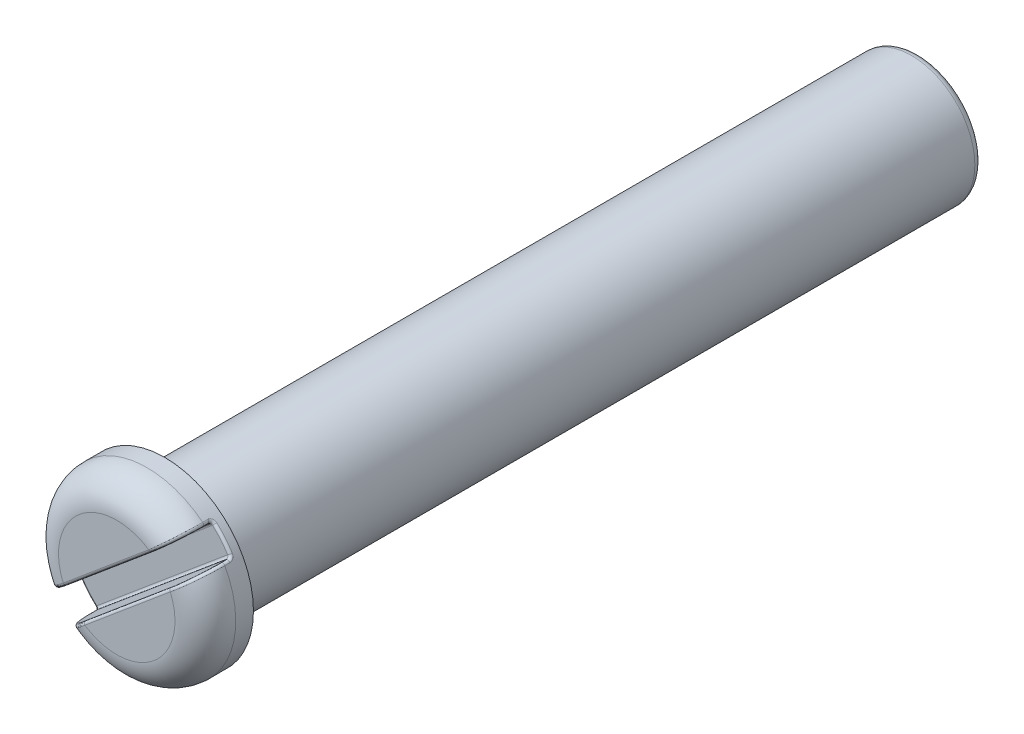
ISO-10303-21;
HEADER;
FILE_DESCRIPTION(('STEP AP214'),'2;1');
FILE_NAME('part.step','',(''),(''),'','','');
FILE_SCHEMA(('AUTOMOTIVE_DESIGN { 1 0 10303 214 1 1 1 1 }'));
ENDSEC;
DATA;
#1=APPLICATION_CONTEXT('core data for automotive mechanical design processes');
#2=APPLICATION_PROTOCOL_DEFINITION('international standard','automotive_design',2000,#1);
#3=PRODUCT_CONTEXT('',#1,'mechanical');
#4=PRODUCT('Part','Part','',(#3));
#5=PRODUCT_RELATED_PRODUCT_CATEGORY('part','',(#4));
#6=PRODUCT_DEFINITION_FORMATION('','',#4);
#7=PRODUCT_DEFINITION_CONTEXT('part definition',#1,'design');
#8=PRODUCT_DEFINITION('design','',#6,#7);
#9=PRODUCT_DEFINITION_SHAPE('','',#8);
#10=(LENGTH_UNIT() NAMED_UNIT(*) SI_UNIT(.MILLI.,.METRE.));
#11=(NAMED_UNIT(*) PLANE_ANGLE_UNIT() SI_UNIT($,.RADIAN.));
#12=(NAMED_UNIT(*) SI_UNIT($,.STERADIAN.) SOLID_ANGLE_UNIT());
#13=UNCERTAINTY_MEASURE_WITH_UNIT(LENGTH_MEASURE(1.E-05),#10,'distance_accuracy_value','');
#14=(GEOMETRIC_REPRESENTATION_CONTEXT(3) GLOBAL_UNCERTAINTY_ASSIGNED_CONTEXT((#13)) GLOBAL_UNIT_ASSIGNED_CONTEXT((#10,
#11,#12)) REPRESENTATION_CONTEXT('',''));
#15=CARTESIAN_POINT('',(0.,0.,0.));
#16=DIRECTION('',(0.,0.,1.));
#17=DIRECTION('',(1.,0.,0.));
#18=AXIS2_PLACEMENT_3D('',#15,#16,#17);
#19=CARTESIAN_POINT('',(201.584204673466,16.3795655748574,15.9));
#20=DIRECTION('',(0.,0.,1.));
#21=DIRECTION('',(1.,0.,0.));
#22=AXIS2_PLACEMENT_3D('',#19,#20,#21);
#23=PLANE('',#22);
#24=CARTESIAN_POINT('',(201.584204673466,16.3795655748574,15.9));
#25=DIRECTION('',(0.,0.,1.));
#26=DIRECTION('',(1.,0.,0.));
#27=AXIS2_PLACEMENT_3D('',#24,#25,#26);
#28=CIRCLE('',#27,2.29999999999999);
#29=CARTESIAN_POINT('',(200.321647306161,14.4570804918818,15.9));
#30=VERTEX_POINT('',#29);
#31=CARTESIAN_POINT('',(203.698100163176,17.2859020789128,15.9));
#32=VERTEX_POINT('',#31);
#33=EDGE_CURVE('E556',#30,#32,#28,.T.);
#34=ORIENTED_EDGE('',*,*,#33,.T.);
#35=DIRECTION('',(0.766531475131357,0.642206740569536,0.));
#36=VECTOR('',#35,1.);
#37=CARTESIAN_POINT('',(200.300451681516,14.4393226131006,15.9));
#38=LINE('',#37,#36);
#39=EDGE_CURVE('E363',#32,#30,#38,.F.);
#40=ORIENTED_EDGE('',*,*,#39,.T.);
#41=EDGE_LOOP('',(#34,#40));
#42=FACE_BOUND('',#41,.T.);
#43=ADVANCED_FACE('F33',(#42),#23,.T.);
#44=CARTESIAN_POINT('',(201.584204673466,16.3795655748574,14.7));
#45=DIRECTION('',(0.,0.,1.));
#46=DIRECTION('',(1.,0.,0.));
#47=AXIS2_PLACEMENT_3D('',#44,#45,#46);
#48=TOROIDAL_SURFACE('',#47,2.29999999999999,1.2);
#49=CARTESIAN_POINT('',(201.584204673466,16.3795655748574,14.7));
#50=DIRECTION('',(0.,0.,1.));
#51=DIRECTION('',(1.,0.,0.));
#52=AXIS2_PLACEMENT_3D('',#49,#50,#51);
#53=CIRCLE('',#52,3.49999999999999);
#54=CARTESIAN_POINT('',(204.653779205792,18.0611458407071,14.7));
#55=VERTEX_POINT('',#54);
#56=CARTESIAN_POINT('',(199.391007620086,13.651950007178,14.7));
#57=VERTEX_POINT('',#56);
#58=EDGE_CURVE('E555',#55,#57,#53,.F.);
#59=ORIENTED_EDGE('',*,*,#58,.F.);
#60=CARTESIAN_POINT('',(204.454931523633,18.0504397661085,14.3416087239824));
#61=CARTESIAN_POINT('',(204.542365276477,18.1236925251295,14.3015029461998));
#62=CARTESIAN_POINT('',(204.602230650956,18.0189136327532,14.3090276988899));
#63=CARTESIAN_POINT('',(204.470461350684,18.0634507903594,14.3990590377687));
#64=CARTESIAN_POINT('',(204.559860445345,18.1383501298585,14.3653627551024));
#65=CARTESIAN_POINT('',(204.619291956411,18.0328874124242,14.3717007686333));
#66=CARTESIAN_POINT('',(204.482194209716,18.0732806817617,14.4582383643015));
#67=CARTESIAN_POINT('',(204.573077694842,18.1494236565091,14.4310818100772));
#68=CARTESIAN_POINT('',(204.632180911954,18.0434469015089,14.4362600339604));
#69=CARTESIAN_POINT('',(204.497887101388,18.0864283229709,14.5782788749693));
#70=CARTESIAN_POINT('',(204.590778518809,18.1642535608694,14.5645830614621));
#71=CARTESIAN_POINT('',(204.64941946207,18.057571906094,14.5672133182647));
#72=CARTESIAN_POINT('',(204.501853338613,18.0897512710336,14.6391386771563));
#73=CARTESIAN_POINT('',(204.595242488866,18.167993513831,14.6322655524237));
#74=CARTESIAN_POINT('',(204.653775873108,18.0611430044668,14.6336058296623));
#75=CARTESIAN_POINT('',(204.501859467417,18.0897564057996,14.7608921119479));
#76=CARTESIAN_POINT('',(204.595246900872,18.1679972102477,14.7677686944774));
#77=CARTESIAN_POINT('',(204.653782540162,18.0611486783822,14.7664277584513));
#78=CARTESIAN_POINT('',(204.497895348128,18.0864352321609,14.8217857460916));
#79=CARTESIAN_POINT('',(204.590782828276,18.1642571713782,14.8354875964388));
#80=CARTESIAN_POINT('',(204.649428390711,18.057579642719,14.8328571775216));
#81=CARTESIAN_POINT('',(204.482169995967,18.0732603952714,14.9418188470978));
#82=CARTESIAN_POINT('',(204.573055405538,18.1494049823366,14.9689830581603));
#83=CARTESIAN_POINT('',(204.632154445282,18.0434247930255,14.9638023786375));
#84=CARTESIAN_POINT('',(204.470410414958,18.0634081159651,15.000958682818));
#85=CARTESIAN_POINT('',(204.559820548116,18.1383167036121,15.0346620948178));
#86=CARTESIAN_POINT('',(204.619236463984,18.0328404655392,15.0283185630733));
#87=CARTESIAN_POINT('',(204.439468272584,18.037484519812,15.1157658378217));
#88=CARTESIAN_POINT('',(204.524980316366,18.1091272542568,15.1620748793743));
#89=CARTESIAN_POINT('',(204.585242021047,18.0050008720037,15.15356273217));
#90=CARTESIAN_POINT('',(204.420293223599,18.0214194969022,15.1714366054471));
#91=CARTESIAN_POINT('',(204.503435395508,18.0910767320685,15.223726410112));
#92=CARTESIAN_POINT('',(204.564173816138,17.9877523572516,15.2142944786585));
#93=CARTESIAN_POINT('',(204.375063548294,17.9835256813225,15.2779152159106));
#94=CARTESIAN_POINT('',(204.452613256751,18.0484975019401,15.3414561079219));
#95=CARTESIAN_POINT('',(204.514469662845,17.9470886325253,15.3304529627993));
#96=CARTESIAN_POINT('',(204.348997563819,17.9616873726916,15.3287148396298));
#97=CARTESIAN_POINT('',(204.423398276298,18.0240209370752,15.3974581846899));
#98=CARTESIAN_POINT('',(204.485821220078,17.9236632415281,15.3858707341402));
#99=CARTESIAN_POINT('',(204.290591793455,17.9127545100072,15.4242801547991));
#100=CARTESIAN_POINT('',(204.3579634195,17.969199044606,15.502519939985));
#101=CARTESIAN_POINT('',(204.421613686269,17.8712123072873,15.4901238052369));
#102=CARTESIAN_POINT('',(204.258213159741,17.8856274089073,15.4690054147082));
#103=CARTESIAN_POINT('',(204.321795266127,17.9388970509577,15.5514933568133));
#104=CARTESIAN_POINT('',(204.386011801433,17.842152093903,15.5389149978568));
#105=CARTESIAN_POINT('',(204.188302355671,17.8270555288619,15.5508111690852));
#106=CARTESIAN_POINT('',(204.243769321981,17.8735262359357,15.6406746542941));
#107=CARTESIAN_POINT('',(204.309118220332,17.77946655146,15.628157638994));
#108=CARTESIAN_POINT('',(204.150777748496,17.7956170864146,15.5879026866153));
#109=CARTESIAN_POINT('',(204.202031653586,17.8385580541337,15.6808852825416));
#110=CARTESIAN_POINT('',(204.26783487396,17.7458479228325,15.6686211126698));
#111=CARTESIAN_POINT('',(204.070836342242,17.7286414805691,15.654261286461));
#112=CARTESIAN_POINT('',(204.11324241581,17.7641696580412,15.7523071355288));
#113=CARTESIAN_POINT('',(204.179853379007,17.6743164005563,15.7410123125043));
#114=CARTESIAN_POINT('',(204.028339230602,17.6930370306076,15.683363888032));
#115=CARTESIAN_POINT('',(204.066222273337,17.7247757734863,15.7833654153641));
#116=CARTESIAN_POINT('',(204.133066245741,17.6363332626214,15.7727606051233));
#117=CARTESIAN_POINT('',(203.940338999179,17.6193096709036,15.732118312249));
#118=CARTESIAN_POINT('',(203.969044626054,17.6433594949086,15.8347193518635));
#119=CARTESIAN_POINT('',(204.036138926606,17.5578073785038,15.8259472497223));
#120=CARTESIAN_POINT('',(203.89483777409,17.5811883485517,15.7517760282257));
#121=CARTESIAN_POINT('',(203.919017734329,17.601446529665,15.8550932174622));
#122=CARTESIAN_POINT('',(203.986000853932,17.5172662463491,15.8473920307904));
#123=CARTESIAN_POINT('',(203.77829490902,17.4835477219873,15.7888236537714));
#124=CARTESIAN_POINT('',(203.791613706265,17.4947063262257,15.8922153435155));
#125=CARTESIAN_POINT('',(203.857513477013,17.4136424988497,15.8878076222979));
#126=CARTESIAN_POINT('',(203.706025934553,17.4230001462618,15.7999832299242));
#127=CARTESIAN_POINT('',(203.712975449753,17.4288225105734,15.9023742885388));
#128=CARTESIAN_POINT('',(203.777777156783,17.3495754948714,15.8999817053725));
#129=CARTESIAN_POINT('',(203.580654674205,17.317963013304,15.8000123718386));
#130=CARTESIAN_POINT('',(203.576714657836,17.3146620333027,15.8982840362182));
#131=CARTESIAN_POINT('',(203.639319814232,17.2389280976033,15.9000134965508));
#132=CARTESIAN_POINT('',(203.527496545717,17.2734266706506,15.7939602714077));
#133=CARTESIAN_POINT('',(203.519452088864,17.2666869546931,15.8900226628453));
#134=CARTESIAN_POINT('',(203.580571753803,17.1921683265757,15.8934112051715));
#135=CARTESIAN_POINT('',(203.422575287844,17.1855227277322,15.7702583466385));
#136=CARTESIAN_POINT('',(203.406970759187,17.1724491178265,15.8606812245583));
#137=CARTESIAN_POINT('',(203.464535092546,17.100262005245,15.8675545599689));
#138=CARTESIAN_POINT('',(203.370816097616,17.1421584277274,15.7525787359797));
#139=CARTESIAN_POINT('',(203.351836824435,17.1262574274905,15.8398423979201));
#140=CARTESIAN_POINT('',(203.407250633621,17.0551199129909,15.8482677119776));
#141=CARTESIAN_POINT('',(203.320529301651,17.1000277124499,15.7293686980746));
#142=CARTESIAN_POINT('',(203.297940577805,17.081102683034,15.8127569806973));
#143=CARTESIAN_POINT('',(203.351552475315,17.0115043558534,15.8229476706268));
#144=(BOUNDED_SURFACE() B_SPLINE_SURFACE(3,2,((#60,#61,#62),(#63,#64,#65),(#66,#67,#68),(#69,
#70,#71),(#72,#73,#74),(#75,#76,#77),(#78,#79,#80),(#81,#82,#83),(#84,#85,#86),(#87,#88,#89),
(#90,#91,#92),(#93,#94,#95),(#96,#97,#98),(#99,#100,#101),(#102,#103,#104),(#105,#106,#107),
(#108,#109,#110),(#111,#112,#113),(#114,#115,#116),(#117,#118,#119),(#120,#121,#122),(#123,#124,
#125),(#126,#127,#128),(#129,#130,#131),(#132,#133,#134),(#135,#136,#137),(#138,#139,#140),
(#141,#142,#143)),.UNSPECIFIED.,.F.,.F.,.F.) B_SPLINE_SURFACE_WITH_KNOTS((4,2,2,2,2,2,2,2,2,2,2,
2,2,4),(3,3),(0.,0.182515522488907,0.364885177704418,0.547347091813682,0.729770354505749,
0.912009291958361,1.09455050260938,1.27825270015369,1.46168774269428,1.64865620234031,
1.83550784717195,2.11732497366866,2.32523077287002,2.53367125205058),(0.,1.),
.UNSPECIFIED.) GEOMETRIC_REPRESENTATION_ITEM() RATIONAL_B_SPLINE_SURFACE(((1.,0.637329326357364,
1.),(1.,0.636365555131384,1.),(1.,0.635645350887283,1.),(1.,0.634687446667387,1.),(1.,
0.634449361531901,1.),(1.,0.634449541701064,1.),(1.,0.634688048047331,1.),(1.,0.635645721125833,
1.),(1.,0.636364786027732,1.),(1.,0.638292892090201,1.),(1.,0.639501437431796,1.),(1.,
0.642427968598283,1.),(1.,0.644146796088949,1.),(1.,0.648129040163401,1.),(1.,0.650395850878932,
1.),(1.,0.655492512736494,1.),(1.,0.658321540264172,1.),(1.,0.66463777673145,1.),(1.,
0.668136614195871,1.),(1.,0.675781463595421,1.),(1.,0.679927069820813,1.),(1.,0.691194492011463,
1.),(1.,0.698758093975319,1.),(1.,0.713265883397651,1.),(1.,0.719852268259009,1.),(1.,
0.733852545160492,1.),(1.,0.741268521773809,1.),(1.,0.749068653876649,1.))) REPRESENTATION_ITEM('') SURFACE());
#145=CARTESIAN_POINT('',(204.602230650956,18.0189136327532,14.3090276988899));
#146=CARTESIAN_POINT('',(204.619291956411,18.0328874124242,14.3717007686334));
#147=CARTESIAN_POINT('',(204.632180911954,18.0434469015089,14.4362600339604));
#148=CARTESIAN_POINT('',(204.64941946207,18.057571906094,14.5672133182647));
#149=CARTESIAN_POINT('',(204.653775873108,18.0611430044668,14.6336058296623));
#150=CARTESIAN_POINT('',(204.653782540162,18.0611486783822,14.7664277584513));
#151=CARTESIAN_POINT('',(204.649428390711,18.057579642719,14.8328571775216));
#152=CARTESIAN_POINT('',(204.632154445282,18.0434247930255,14.9638023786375));
#153=CARTESIAN_POINT('',(204.619236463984,18.0328404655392,15.0283185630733));
#154=CARTESIAN_POINT('',(204.585242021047,18.0050008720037,15.15356273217));
#155=CARTESIAN_POINT('',(204.564173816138,17.9877523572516,15.2142944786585));
#156=CARTESIAN_POINT('',(204.514469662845,17.9470886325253,15.3304529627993));
#157=CARTESIAN_POINT('',(204.485821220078,17.9236632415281,15.3858707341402));
#158=CARTESIAN_POINT('',(204.421613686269,17.8712123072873,15.4901238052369));
#159=CARTESIAN_POINT('',(204.386011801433,17.842152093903,15.5389149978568));
#160=CARTESIAN_POINT('',(204.309118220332,17.77946655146,15.628157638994));
#161=CARTESIAN_POINT('',(204.26783487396,17.7458479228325,15.6686211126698));
#162=CARTESIAN_POINT('',(204.179853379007,17.6743164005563,15.7410123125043));
#163=CARTESIAN_POINT('',(204.133066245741,17.6363332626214,15.7727606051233));
#164=CARTESIAN_POINT('',(204.036138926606,17.5578073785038,15.8259472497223));
#165=CARTESIAN_POINT('',(203.986000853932,17.5172662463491,15.8473920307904));
#166=CARTESIAN_POINT('',(203.857513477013,17.4136424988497,15.8878076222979));
#167=CARTESIAN_POINT('',(203.777777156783,17.3495754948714,15.8999817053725));
#168=CARTESIAN_POINT('',(203.639319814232,17.2389280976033,15.9000134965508));
#169=CARTESIAN_POINT('',(203.580571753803,17.1921683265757,15.8934112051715));
#170=CARTESIAN_POINT('',(203.464535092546,17.100262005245,15.8675545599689));
#171=CARTESIAN_POINT('',(203.407250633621,17.0551199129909,15.8482677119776));
#172=CARTESIAN_POINT('',(203.351552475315,17.0115043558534,15.8229476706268));
#173=B_SPLINE_CURVE_WITH_KNOTS('',3,(#145,#146,#147,#148,#149,#150,#151,#152,#153,#154,#155,
#156,#157,#158,#159,#160,#161,#162,#163,#164,#165,#166,#167,#168,#169,#170,#171,#172),
.UNSPECIFIED.,.F.,.F.,(4,2,2,2,2,2,2,2,2,2,2,2,2,4),(0.,0.182515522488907,0.364885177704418,
0.547347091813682,0.729770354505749,0.912009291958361,1.09455050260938,1.27825270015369,
1.46168774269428,1.64865620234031,1.83550784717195,2.11732497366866,2.32523077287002,
2.53367125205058),.UNSPECIFIED.);
#174=EDGE_CURVE('E357',#55,#32,#173,.T.);
#175=ORIENTED_EDGE('',*,*,#174,.T.);
#176=ORIENTED_EDGE('',*,*,#33,.F.);
#177=CARTESIAN_POINT('',(200.570776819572,14.7962611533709,15.7293686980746));
#178=CARTESIAN_POINT('',(200.593365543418,14.8151861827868,15.8127569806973));
#179=CARTESIAN_POINT('',(200.652498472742,14.7502134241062,15.8229476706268));
#180=CARTESIAN_POINT('',(200.520611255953,14.7542320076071,15.7525588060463));
#181=CARTESIAN_POINT('',(200.539594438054,14.770136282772,15.8398118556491));
#182=CARTESIAN_POINT('',(200.599929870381,14.7031283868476,15.8482459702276));
#183=CARTESIAN_POINT('',(200.468913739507,14.7109193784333,15.7702113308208));
#184=CARTESIAN_POINT('',(200.484529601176,14.7240024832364,15.8606216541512));
#185=CARTESIAN_POINT('',(200.545517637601,14.6546934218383,15.8675032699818));
#186=CARTESIAN_POINT('',(200.363954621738,14.6229837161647,15.7939330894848));
#187=CARTESIAN_POINT('',(200.372010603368,14.6297330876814,15.8899908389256));
#188=CARTESIAN_POINT('',(200.434669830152,14.556511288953,15.8933815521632));
#189=CARTESIAN_POINT('',(200.310692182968,14.5783599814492,15.7999960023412));
#190=CARTESIAN_POINT('',(200.314637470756,14.5816653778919,15.8982689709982));
#191=CARTESIAN_POINT('',(200.378233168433,14.5067634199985,15.899995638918));
#192=CARTESIAN_POINT('',(200.207259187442,14.4917029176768,15.8000037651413));
#193=CARTESIAN_POINT('',(200.202623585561,14.4878191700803,15.9016581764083));
#194=CARTESIAN_POINT('',(200.268352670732,14.4102872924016,15.9000041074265));
#195=CARTESIAN_POINT('',(200.157088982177,14.4496698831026,15.7946329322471));
#196=CARTESIAN_POINT('',(200.148078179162,14.4421205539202,15.8973051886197));
#197=CARTESIAN_POINT('',(200.214925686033,14.3635516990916,15.8941450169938));
#198=CARTESIAN_POINT('',(200.058159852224,14.3667861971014,15.7730759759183));
#199=CARTESIAN_POINT('',(200.039955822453,14.3515347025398,15.8767076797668));
#200=CARTESIAN_POINT('',(200.109382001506,14.2714925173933,15.8706283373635));
#201=CARTESIAN_POINT('',(200.009399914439,14.3259346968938,15.7568978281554));
#202=CARTESIAN_POINT('',(199.986511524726,14.3067586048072,15.8603188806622));
#203=CARTESIAN_POINT('',(200.057264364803,14.2261679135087,15.8529794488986));
#204=CARTESIAN_POINT('',(199.9146348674,14.2465397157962,15.7139507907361));
#205=CARTESIAN_POINT('',(199.882141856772,14.2193167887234,15.8157163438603));
#206=CARTESIAN_POINT('',(199.955834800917,14.1381548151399,15.8061281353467));
#207=CARTESIAN_POINT('',(199.868632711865,14.2079987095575,15.6871707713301));
#208=CARTESIAN_POINT('',(199.831367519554,14.1767776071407,15.7873874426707));
#209=CARTESIAN_POINT('',(199.90652588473,14.0954691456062,15.7769135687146));
#210=CARTESIAN_POINT('',(199.780794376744,14.1344069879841,15.6235801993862));
#211=CARTESIAN_POINT('',(199.733992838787,14.0951962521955,15.719376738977));
#212=CARTESIAN_POINT('',(199.812277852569,14.0140183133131,15.7075420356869));
#213=CARTESIAN_POINT('',(199.738964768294,14.0993617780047,15.5867541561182));
#214=CARTESIAN_POINT('',(199.687549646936,14.0562857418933,15.6796266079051));
#215=CARTESIAN_POINT('',(199.76734563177,13.9752593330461,15.6673681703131));
#216=CARTESIAN_POINT('',(199.662016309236,14.0348936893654,15.5052515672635));
#217=CARTESIAN_POINT('',(199.601793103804,13.9844381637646,15.591072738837));
#218=CARTESIAN_POINT('',(199.684628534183,13.9039961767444,15.5784562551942));
#219=CARTESIAN_POINT('',(199.626741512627,14.0053401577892,15.4608256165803));
#220=CARTESIAN_POINT('',(199.562436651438,13.9514649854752,15.5425436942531));
#221=CARTESIAN_POINT('',(199.646677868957,13.8713464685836,15.5299915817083));
#222=CARTESIAN_POINT('',(199.562661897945,13.9516536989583,15.3647740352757));
#223=CARTESIAN_POINT('',(199.490708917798,13.8913708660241,15.4371435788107));
#224=CARTESIAN_POINT('',(199.577701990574,13.8120574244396,15.425208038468));
#225=CARTESIAN_POINT('',(199.533845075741,13.9275107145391,15.3131620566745));
#226=CARTESIAN_POINT('',(199.458437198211,13.8643333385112,15.3803257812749));
#227=CARTESIAN_POINT('',(199.546663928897,13.7854069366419,15.3689040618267));
#228=CARTESIAN_POINT('',(199.484159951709,13.8858840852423,15.2055368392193));
#229=CARTESIAN_POINT('',(199.402643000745,13.8175884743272,15.2614591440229));
#230=CARTESIAN_POINT('',(199.493130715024,13.7394685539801,15.2514947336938));
#231=CARTESIAN_POINT('',(199.463111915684,13.8682498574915,15.1496648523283));
#232=CARTESIAN_POINT('',(199.379004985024,13.7977843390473,15.1996344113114));
#233=CARTESIAN_POINT('',(199.470442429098,13.7200141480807,15.1905434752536));
#234=CARTESIAN_POINT('',(199.428657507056,13.8393836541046,15.0341379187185));
#235=CARTESIAN_POINT('',(199.340223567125,13.7652929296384,15.0714994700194));
#236=CARTESIAN_POINT('',(199.433295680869,13.6881731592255,15.0645140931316));
#237=CARTESIAN_POINT('',(199.415241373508,13.8281435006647,14.9744879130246));
#238=CARTESIAN_POINT('',(199.325129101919,13.75264665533,15.0052823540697));
#239=CARTESIAN_POINT('',(199.418826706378,13.6757775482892,14.9994413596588));
#240=CARTESIAN_POINT('',(199.394956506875,13.8111486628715,14.8434584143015));
#241=CARTESIAN_POINT('',(199.30226062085,13.7334872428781,14.8595759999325));
#242=CARTESIAN_POINT('',(199.396948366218,13.6570367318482,14.856500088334));
#243=CARTESIAN_POINT('',(199.38945014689,13.8065353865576,14.7717101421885));
#244=CARTESIAN_POINT('',(199.296062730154,13.7282945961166,14.7798085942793));
#245=CARTESIAN_POINT('',(199.39100803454,13.6519504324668,14.7782292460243));
#246=CARTESIAN_POINT('',(199.389449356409,13.8065347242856,14.6392385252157));
#247=CARTESIAN_POINT('',(199.296060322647,13.7282925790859,14.632376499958));
#248=CARTESIAN_POINT('',(199.391007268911,13.6519496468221,14.6337147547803));
#249=CARTESIAN_POINT('',(199.393401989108,13.8098462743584,14.5785044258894));
#250=CARTESIAN_POINT('',(199.300508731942,13.7320194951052,14.56483370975));
#251=CARTESIAN_POINT('',(199.395271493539,13.6556007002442,14.5674593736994));
#252=CARTESIAN_POINT('',(199.409068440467,13.8229717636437,14.4584748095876));
#253=CARTESIAN_POINT('',(199.318179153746,13.746823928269,14.4313447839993));
#254=CARTESIAN_POINT('',(199.412168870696,13.6700744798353,14.4365179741));
#255=CARTESIAN_POINT('',(199.420818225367,13.8328158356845,14.3991872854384));
#256=CARTESIAN_POINT('',(199.331415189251,13.7579131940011,14.3655056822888));
#257=CARTESIAN_POINT('',(199.424840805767,13.6809304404,14.3718406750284));
#258=CARTESIAN_POINT('',(199.436374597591,13.8458490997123,14.3416087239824));
#259=CARTESIAN_POINT('',(199.348940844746,13.7725963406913,14.3015029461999));
#260=CARTESIAN_POINT('',(199.441615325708,13.6953052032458,14.3090276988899));
#261=(BOUNDED_SURFACE() B_SPLINE_SURFACE(3,2,((#177,#178,#179),(#180,#181,#182),(#183,#184,
#185),(#186,#187,#188),(#189,#190,#191),(#192,#193,#194),(#195,#196,#197),(#198,#199,#200),
(#201,#202,#203),(#204,#205,#206),(#207,#208,#209),(#210,#211,#212),(#213,#214,#215),(#216,#217,
#218),(#219,#220,#221),(#222,#223,#224),(#225,#226,#227),(#228,#229,#230),(#231,#232,#233),
(#234,#235,#236),(#237,#238,#239),(#240,#241,#242),(#243,#244,#245),(#246,#247,#248),(#249,#250,
#251),(#252,#253,#254),(#255,#256,#257),(#258,#259,#260)),.UNSPECIFIED.,.F.,.F.,
.F.) B_SPLINE_SURFACE_WITH_KNOTS((4,2,2,2,2,2,2,2,2,2,2,2,2,4),(3,3),(0.,0.20811638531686,
0.416346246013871,0.612464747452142,0.808438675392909,1.0046188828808,1.20110332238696,
1.39204838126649,1.58263551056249,1.76848630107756,1.95409885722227,2.16891701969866,
2.35093685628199,2.53380219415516),(0.,1.),
.UNSPECIFIED.) GEOMETRIC_REPRESENTATION_ITEM() RATIONAL_B_SPLINE_SURFACE(((1.,0.749068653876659,
1.),(1.,0.741284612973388,1.),(1.,0.733877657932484,1.),(1.,0.719870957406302,1.),(1.,
0.713271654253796,1.),(1.,0.701300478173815,1.),(1.,0.695879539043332,1.),(1.,0.685799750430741,
1.),(1.,0.681140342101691,1.),(1.,0.672548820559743,1.),(1.,0.668617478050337,1.),(1.,
0.661445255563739,1.),(1.,0.65820545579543,1.),(1.,0.652467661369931,1.),(1.,0.649951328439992,
1.),(1.,0.645512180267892,1.),(1.,0.643588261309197,1.),(1.,0.640340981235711,1.),(1.,
0.639003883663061,1.),(1.,0.636843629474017,1.),(1.,0.63601981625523,1.),(1.,0.63478050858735,
1.),(1.,0.634449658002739,1.),(1.,0.634449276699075,1.),(1.,0.634686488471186,1.),(1.,
0.635642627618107,1.),(1.,0.636363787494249,1.),(1.,0.637329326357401,1.))) REPRESENTATION_ITEM('') SURFACE());
#262=CARTESIAN_POINT('',(200.652498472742,14.7502134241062,15.8229476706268));
#263=CARTESIAN_POINT('',(200.599929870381,14.7031283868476,15.8482459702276));
#264=CARTESIAN_POINT('',(200.545517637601,14.6546934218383,15.8675032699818));
#265=CARTESIAN_POINT('',(200.434669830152,14.556511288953,15.8933815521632));
#266=CARTESIAN_POINT('',(200.378233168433,14.5067634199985,15.899995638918));
#267=CARTESIAN_POINT('',(200.268352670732,14.4102872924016,15.9000041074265));
#268=CARTESIAN_POINT('',(200.214925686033,14.3635516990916,15.8941450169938));
#269=CARTESIAN_POINT('',(200.109382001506,14.2714925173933,15.8706283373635));
#270=CARTESIAN_POINT('',(200.057264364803,14.2261679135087,15.8529794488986));
#271=CARTESIAN_POINT('',(199.955834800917,14.1381548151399,15.8061281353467));
#272=CARTESIAN_POINT('',(199.90652588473,14.0954691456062,15.7769135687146));
#273=CARTESIAN_POINT('',(199.812277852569,14.0140183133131,15.7075420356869));
#274=CARTESIAN_POINT('',(199.76734563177,13.9752593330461,15.6673681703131));
#275=CARTESIAN_POINT('',(199.684628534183,13.9039961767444,15.5784562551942));
#276=CARTESIAN_POINT('',(199.646677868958,13.8713464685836,15.5299915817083));
#277=CARTESIAN_POINT('',(199.577701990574,13.8120574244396,15.425208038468));
#278=CARTESIAN_POINT('',(199.546663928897,13.7854069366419,15.3689040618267));
#279=CARTESIAN_POINT('',(199.493130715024,13.7394685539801,15.2514947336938));
#280=CARTESIAN_POINT('',(199.470442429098,13.7200141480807,15.1905434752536));
#281=CARTESIAN_POINT('',(199.433295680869,13.6881731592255,15.0645140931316));
#282=CARTESIAN_POINT('',(199.418826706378,13.6757775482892,14.9994413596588));
#283=CARTESIAN_POINT('',(199.396948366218,13.6570367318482,14.856500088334));
#284=CARTESIAN_POINT('',(199.39100803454,13.6519504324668,14.7782292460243));
#285=CARTESIAN_POINT('',(199.391007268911,13.6519496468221,14.6337147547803));
#286=CARTESIAN_POINT('',(199.395271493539,13.6556007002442,14.5674593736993));
#287=CARTESIAN_POINT('',(199.412168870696,13.6700744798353,14.4365179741));
#288=CARTESIAN_POINT('',(199.424840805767,13.6809304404,14.3718406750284));
#289=CARTESIAN_POINT('',(199.441615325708,13.6953052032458,14.3090276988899));
#290=B_SPLINE_CURVE_WITH_KNOTS('',3,(#262,#263,#264,#265,#266,#267,#268,#269,#270,#271,#272,
#273,#274,#275,#276,#277,#278,#279,#280,#281,#282,#283,#284,#285,#286,#287,#288,#289),
.UNSPECIFIED.,.F.,.F.,(4,2,2,2,2,2,2,2,2,2,2,2,2,4),(0.,0.20811638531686,0.416346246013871,
0.612464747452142,0.808438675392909,1.0046188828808,1.20110332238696,1.39204838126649,
1.58263551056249,1.76848630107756,1.95409885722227,2.16891701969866,2.35093685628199,
2.53380219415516),.UNSPECIFIED.);
#291=EDGE_CURVE('E351',#30,#57,#290,.T.);
#292=ORIENTED_EDGE('',*,*,#291,.T.);
#293=EDGE_LOOP('',(#59,#175,#176,#292));
#294=FACE_BOUND('',#293,.T.);
#295=ADVANCED_FACE('F327',(#294),#48,.T.);
#296=CARTESIAN_POINT('',(201.584204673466,16.3795655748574,-15.8));
#297=DIRECTION('',(0.,0.,1.));
#298=DIRECTION('',(1.,0.,0.));
#299=AXIS2_PLACEMENT_3D('',#296,#297,#298);
#300=CYLINDRICAL_SURFACE('',#299,2.5);
#301=CARTESIAN_POINT('',(201.584204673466,16.3795655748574,-15.5));
#302=DIRECTION('',(0.,0.,1.));
#303=DIRECTION('',(1.,0.,0.));
#304=AXIS2_PLACEMENT_3D('',#301,#302,#303);
#305=CIRCLE('',#304,2.5);
#306=CARTESIAN_POINT('',(204.084204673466,16.3795655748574,-15.5));
#307=VERTEX_POINT('',#306);
#308=EDGE_CURVE('E578',#307,#307,#305,.T.);
#309=ORIENTED_EDGE('',*,*,#308,.T.);
#310=EDGE_LOOP('',(#309));
#311=FACE_BOUND('',#310,.T.);
#312=CARTESIAN_POINT('',(201.584204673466,16.3795655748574,14.));
#313=DIRECTION('',(0.,0.,1.));
#314=DIRECTION('',(1.,0.,0.));
#315=AXIS2_PLACEMENT_3D('',#312,#313,#314);
#316=CIRCLE('',#315,2.5);
#317=CARTESIAN_POINT('',(204.084204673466,16.3795655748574,14.));
#318=VERTEX_POINT('',#317);
#319=EDGE_CURVE('E581',#318,#318,#316,.T.);
#320=ORIENTED_EDGE('',*,*,#319,.F.);
#321=EDGE_LOOP('',(#320));
#322=FACE_BOUND('',#321,.T.);
#323=ADVANCED_FACE('F544',(#311,#322),#300,.T.);
#324=CARTESIAN_POINT('',(201.584204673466,16.3795655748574,-15.8));
#325=DIRECTION('',(0.,0.,1.));
#326=DIRECTION('',(1.,0.,0.));
#327=AXIS2_PLACEMENT_3D('',#324,#325,#326);
#328=PLANE('',#327);
#329=CARTESIAN_POINT('',(201.584204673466,16.3795655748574,-15.8));
#330=DIRECTION('',(0.,0.,1.));
#331=DIRECTION('',(1.,0.,0.));
#332=AXIS2_PLACEMENT_3D('',#329,#330,#331);
#333=CIRCLE('',#332,2.2);
#334=CARTESIAN_POINT('',(203.784204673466,16.3795655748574,-15.8));
#335=VERTEX_POINT('',#334);
#336=EDGE_CURVE('E575',#335,#335,#333,.F.);
#337=ORIENTED_EDGE('',*,*,#336,.T.);
#338=EDGE_LOOP('',(#337));
#339=FACE_BOUND('',#338,.T.);
#340=ADVANCED_FACE('F216',(#339),#328,.F.);
#341=CARTESIAN_POINT('',(201.584204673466,16.3795655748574,-15.5));
#342=DIRECTION('',(0.,0.,1.));
#343=DIRECTION('',(1.,0.,0.));
#344=AXIS2_PLACEMENT_3D('',#341,#342,#343);
#345=TOROIDAL_SURFACE('',#344,2.2,0.3);
#346=ORIENTED_EDGE('',*,*,#336,.F.);
#347=EDGE_LOOP('',(#346));
#348=FACE_BOUND('',#347,.T.);
#349=ORIENTED_EDGE('',*,*,#308,.F.);
#350=EDGE_LOOP('',(#349));
#351=FACE_BOUND('',#350,.T.);
#352=ADVANCED_FACE('F212',(#348,#351),#345,.T.);
#353=CARTESIAN_POINT('',(201.584204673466,16.3795655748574,15.9));
#354=DIRECTION('',(0.,0.,-1.));
#355=DIRECTION('',(-1.,0.,0.));
#356=AXIS2_PLACEMENT_3D('',#353,#354,#355);
#357=CYLINDRICAL_SURFACE('',#356,3.49999999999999);
#358=CARTESIAN_POINT('',(204.448346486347,18.2192459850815,14.4058224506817));
#359=CARTESIAN_POINT('',(204.5279904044,18.2730170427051,14.4022769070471));
#360=CARTESIAN_POINT('',(204.510357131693,18.2998863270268,14.3116449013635));
#361=CARTESIAN_POINT('',(204.450846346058,18.2142935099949,14.4038939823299));
#362=CARTESIAN_POINT('',(204.53130490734,18.2677798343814,14.4007205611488));
#363=CARTESIAN_POINT('',(204.516501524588,18.2905258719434,14.3077879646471));
#364=CARTESIAN_POINT('',(204.453373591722,18.2091672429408,14.4024366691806));
#365=CARTESIAN_POINT('',(204.534674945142,18.2624402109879,14.3997647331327));
#366=CARTESIAN_POINT('',(204.522773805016,18.2808675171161,14.3048733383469));
#367=CARTESIAN_POINT('',(204.458408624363,18.1987009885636,14.400489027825));
#368=CARTESIAN_POINT('',(204.541407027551,18.2517538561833,14.3990125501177));
#369=CARTESIAN_POINT('',(204.535398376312,18.261211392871,14.3009780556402));
#370=CARTESIAN_POINT('',(204.460916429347,18.1933612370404,14.3999976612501));
#371=CARTESIAN_POINT('',(204.544773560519,18.246399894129,14.3992218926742));
#372=CARTESIAN_POINT('',(204.541750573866,18.2512139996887,14.2999953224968));
#373=CARTESIAN_POINT('',(204.468275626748,18.1772757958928,14.4000046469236));
#374=CARTESIAN_POINT('',(204.554671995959,18.2306403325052,14.4015641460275));
#375=CARTESIAN_POINT('',(204.560601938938,18.2211968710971,14.3000092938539));
#376=CARTESIAN_POINT('',(204.472997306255,18.1663958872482,14.401958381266));
#377=CARTESIAN_POINT('',(204.560992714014,18.2205527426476,14.4054353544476));
#378=CARTESIAN_POINT('',(204.572980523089,18.2010235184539,14.3039167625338));
#379=CARTESIAN_POINT('',(204.481573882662,18.1456446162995,14.4095448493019));
#380=CARTESIAN_POINT('',(204.572192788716,18.202774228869,14.4165323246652));
#381=CARTESIAN_POINT('',(204.59596633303,18.1627642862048,14.319089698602));
#382=CARTESIAN_POINT('',(204.485428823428,18.1357732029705,14.4151773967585));
#383=CARTESIAN_POINT('',(204.57705791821,18.1951080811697,14.4238404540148));
#384=CARTESIAN_POINT('',(204.606573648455,18.1446783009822,14.3303547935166));
#385=CARTESIAN_POINT('',(204.492009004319,18.1182514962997,14.4295087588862));
#386=CARTESIAN_POINT('',(204.585002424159,18.1828098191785,14.4400365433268));
#387=CARTESIAN_POINT('',(204.625020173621,18.1127087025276,14.3590175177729));
#388=CARTESIAN_POINT('',(204.49473453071,18.1106006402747,14.4382067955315));
#389=CARTESIAN_POINT('',(204.588036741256,18.1782531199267,14.4489422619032));
#390=CARTESIAN_POINT('',(204.632860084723,18.0988240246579,14.3764135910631));
#391=CARTESIAN_POINT('',(204.498889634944,18.0986614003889,14.4575964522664));
#392=CARTESIAN_POINT('',(204.592456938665,18.1717938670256,14.4667153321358));
#393=CARTESIAN_POINT('',(204.644951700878,18.0772065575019,14.4151929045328));
#394=CARTESIAN_POINT('',(204.500333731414,18.0943354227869,14.4682640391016));
#395=CARTESIAN_POINT('',(204.593818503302,18.1699280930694,14.4755184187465));
#396=CARTESIAN_POINT('',(204.649243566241,18.0694049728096,14.4365280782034));
#397=CARTESIAN_POINT('',(204.501907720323,18.0896095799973,14.4902669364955));
#398=CARTESIAN_POINT('',(204.595307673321,18.1678988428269,14.4927674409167));
#399=CARTESIAN_POINT('',(204.653926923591,18.060884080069,14.4805338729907));
#400=CARTESIAN_POINT('',(204.502059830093,18.0891433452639,14.501587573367));
#401=CARTESIAN_POINT('',(204.595439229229,18.1677297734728,14.5011186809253));
#402=CARTESIAN_POINT('',(204.654384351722,18.0600450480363,14.5031751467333));
#403=CARTESIAN_POINT('',(204.501351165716,18.0912790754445,14.5180970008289));
#404=CARTESIAN_POINT('',(204.594776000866,18.1686255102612,14.5138017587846));
#405=CARTESIAN_POINT('',(204.652271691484,18.063894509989,14.5361940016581));
#406=CARTESIAN_POINT('',(204.500961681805,18.0924548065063,14.5235040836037));
#407=CARTESIAN_POINT('',(204.594416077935,18.169109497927,14.5180156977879));
#408=CARTESIAN_POINT('',(204.651109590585,18.0660133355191,14.5470081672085));
#409=CARTESIAN_POINT('',(204.499878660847,18.0956837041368,14.5340513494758));
#410=CARTESIAN_POINT('',(204.593371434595,18.1705510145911,14.5265135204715));
#411=CARTESIAN_POINT('',(204.647898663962,18.0718390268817,14.5681026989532));
#412=CARTESIAN_POINT('',(204.49918494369,18.0977373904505,14.5391913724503));
#413=CARTESIAN_POINT('',(204.592689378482,18.1715047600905,14.5307865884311));
#414=CARTESIAN_POINT('',(204.645849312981,18.0755468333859,14.5783827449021));
#415=CARTESIAN_POINT('',(204.498341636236,18.1002010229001,14.5441325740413));
#416=CARTESIAN_POINT('',(204.591824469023,18.1727419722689,14.5351242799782));
#417=CARTESIAN_POINT('',(204.643374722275,18.0800004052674,14.5882651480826));
#418=(BOUNDED_SURFACE() B_SPLINE_SURFACE(3,2,((#358,#359,#360),(#361,#362,#363),(#364,#365,
#366),(#367,#368,#369),(#370,#371,#372),(#373,#374,#375),(#376,#377,#378),(#379,#380,#381),
(#382,#383,#384),(#385,#386,#387),(#388,#389,#390),(#391,#392,#393),(#394,#395,#396),(#397,#398,
#399),(#400,#401,#402),(#403,#404,#405),(#406,#407,#408),(#409,#410,#411),(#412,#413,#414),
(#415,#416,#417)),.UNSPECIFIED.,.F.,.F.,.F.) B_SPLINE_SURFACE_WITH_KNOTS((4,2,2,2,2,2,2,2,2,4),
(3,3),(0.,0.0345360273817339,0.069034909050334,0.1375816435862,0.20612490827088,
0.274650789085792,0.342389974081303,0.408961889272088,0.44202530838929,0.475108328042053),(0.,
1.),.UNSPECIFIED.) GEOMETRIC_REPRESENTATION_ITEM() RATIONAL_B_SPLINE_SURFACE(((1.,
0.720805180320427,1.),(1.,0.718999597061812,1.),(1.,0.716949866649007,1.),(1.,0.712378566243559,
1.),(1.,0.709857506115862,1.),(1.,0.701641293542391,1.),(1.,0.695269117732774,1.),(1.,
0.681631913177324,1.),(1.,0.674366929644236,1.),(1.,0.660464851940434,1.),(1.,0.65382759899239,
1.),(1.,0.643054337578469,1.),(1.,0.638890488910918,1.),(1.,0.634325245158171,1.),(1.,
0.633860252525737,1.),(1.,0.635935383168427,1.),(1.,0.63708071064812,1.),(1.,0.64016800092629,
1.),(1.,0.642110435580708,1.),(1.,0.644392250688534,1.))) REPRESENTATION_ITEM('') SURFACE());
#419=CARTESIAN_POINT('',(204.643374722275,18.0800004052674,14.5882651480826));
#420=CARTESIAN_POINT('',(204.645849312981,18.0755468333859,14.5783827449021));
#421=CARTESIAN_POINT('',(204.647898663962,18.0718390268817,14.5681026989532));
#422=CARTESIAN_POINT('',(204.651109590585,18.0660133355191,14.5470081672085));
#423=CARTESIAN_POINT('',(204.652271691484,18.063894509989,14.5361940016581));
#424=CARTESIAN_POINT('',(204.654384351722,18.0600450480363,14.5031751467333));
#425=CARTESIAN_POINT('',(204.653926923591,18.060884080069,14.4805338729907));
#426=CARTESIAN_POINT('',(204.649243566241,18.0694049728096,14.4365280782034));
#427=CARTESIAN_POINT('',(204.644951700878,18.0772065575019,14.4151929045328));
#428=CARTESIAN_POINT('',(204.632860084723,18.0988240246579,14.3764135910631));
#429=CARTESIAN_POINT('',(204.625020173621,18.1127087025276,14.3590175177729));
#430=CARTESIAN_POINT('',(204.606573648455,18.1446783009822,14.3303547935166));
#431=CARTESIAN_POINT('',(204.59596633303,18.1627642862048,14.319089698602));
#432=CARTESIAN_POINT('',(204.572980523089,18.2010235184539,14.3039167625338));
#433=CARTESIAN_POINT('',(204.560601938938,18.2211968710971,14.3000092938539));
#434=CARTESIAN_POINT('',(204.541750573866,18.2512139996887,14.2999953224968));
#435=CARTESIAN_POINT('',(204.535398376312,18.261211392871,14.3009780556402));
#436=CARTESIAN_POINT('',(204.522773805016,18.2808675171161,14.3048733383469));
#437=CARTESIAN_POINT('',(204.516501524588,18.2905258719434,14.3077879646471));
#438=CARTESIAN_POINT('',(204.510357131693,18.2998863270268,14.3116449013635));
#439=B_SPLINE_CURVE_WITH_KNOTS('',3,(#419,#420,#421,#422,#423,#424,#425,#426,#427,#428,#429,
#430,#431,#432,#433,#434,#435,#436,#437,#438),.UNSPECIFIED.,.F.,.F.,(4,2,2,2,2,2,2,2,2,4),(0.,
0.033083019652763,0.0661464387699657,0.13271835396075,0.200457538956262,0.268983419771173,
0.337526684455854,0.406073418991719,0.440572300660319,0.475108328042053),.UNSPECIFIED.);
#440=CARTESIAN_POINT('',(204.653779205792,18.0611458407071,14.5));
#441=VERTEX_POINT('',#440);
#442=CARTESIAN_POINT('',(204.548061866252,18.2411644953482,14.3));
#443=VERTEX_POINT('',#442);
#444=EDGE_CURVE('E271',#441,#443,#439,.T.);
#445=ORIENTED_EDGE('',*,*,#444,.F.);
#446=DIRECTION('',(0.,0.,-1.));
#447=VECTOR('',#446,1.);
#448=CARTESIAN_POINT('',(204.653779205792,18.0611458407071,15.9));
#449=LINE('',#448,#447);
#450=EDGE_CURVE('E277',#441,#55,#449,.F.);
#451=ORIENTED_EDGE('',*,*,#450,.T.);
#452=ORIENTED_EDGE('',*,*,#58,.T.);
#453=DIRECTION('',(0.,0.,-1.));
#454=VECTOR('',#453,1.);
#455=CARTESIAN_POINT('',(199.391007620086,13.651950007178,15.9));
#456=LINE('',#455,#454);
#457=CARTESIAN_POINT('',(199.391007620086,13.651950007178,14.5));
#458=VERTEX_POINT('',#457);
#459=EDGE_CURVE('E261',#57,#458,#456,.T.);
#460=ORIENTED_EDGE('',*,*,#459,.T.);
#461=CARTESIAN_POINT('',(199.384333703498,13.8093164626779,14.5324679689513));
#462=CARTESIAN_POINT('',(199.294021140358,13.730430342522,14.5252744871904));
#463=CARTESIAN_POINT('',(199.382159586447,13.659088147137,14.5649359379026));
#464=CARTESIAN_POINT('',(199.386020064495,13.8083943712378,14.5272543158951));
#465=CARTESIAN_POINT('',(199.294731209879,13.7296983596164,14.5209781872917));
#466=CARTESIAN_POINT('',(199.385078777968,13.6567266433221,14.5545086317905));
#467=CARTESIAN_POINT('',(199.387300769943,13.8076982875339,14.5218960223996));
#468=CARTESIAN_POINT('',(199.29523995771,13.7291650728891,14.5167580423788));
#469=CARTESIAN_POINT('',(199.387293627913,13.6549400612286,14.5437920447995));
#470=CARTESIAN_POINT('',(199.389016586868,13.8067682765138,14.5110286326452));
#471=CARTESIAN_POINT('',(199.29590474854,13.7284624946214,14.5083564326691));
#472=CARTESIAN_POINT('',(199.390259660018,13.6525506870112,14.5220572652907));
#473=CARTESIAN_POINT('',(199.389452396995,13.80653396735,14.5055196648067));
#474=CARTESIAN_POINT('',(199.296059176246,13.7282948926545,14.5041865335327));
#475=CARTESIAN_POINT('',(199.391012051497,13.6519469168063,14.5110393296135));
#476=CARTESIAN_POINT('',(199.389444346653,13.8065371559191,14.4889270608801));
#477=CARTESIAN_POINT('',(199.296065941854,13.7282907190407,14.4916016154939));
#478=CARTESIAN_POINT('',(199.390998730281,13.6519562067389,14.4778541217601));
#479=CARTESIAN_POINT('',(199.387674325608,13.8074865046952,14.4778110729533));
#480=CARTESIAN_POINT('',(199.295459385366,13.7289553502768,14.4832110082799));
#481=CARTESIAN_POINT('',(199.387944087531,13.6544046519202,14.4556221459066));
#482=CARTESIAN_POINT('',(199.380867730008,13.8112150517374,14.4568665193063));
#483=CARTESIAN_POINT('',(199.292545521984,13.7319437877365,14.4660168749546));
#484=CARTESIAN_POINT('',(199.376158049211,13.6639473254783,14.4137330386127));
#485=CARTESIAN_POINT('',(199.375832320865,13.8139935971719,14.4470374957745));
#486=CARTESIAN_POINT('',(199.290271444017,13.7342344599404,14.4573025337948));
#487=CARTESIAN_POINT('',(199.367428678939,13.6710398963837,14.3940749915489));
#488=CARTESIAN_POINT('',(199.363180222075,13.8212066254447,14.429598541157));
#489=CARTESIAN_POINT('',(199.283208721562,13.7410201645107,14.4401730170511));
#490=CARTESIAN_POINT('',(199.345377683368,13.6892393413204,14.3591970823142));
#491=CARTESIAN_POINT('',(199.355538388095,13.8256572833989,14.4220116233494));
#492=CARTESIAN_POINT('',(199.278458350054,13.7454801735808,14.4317977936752));
#493=CARTESIAN_POINT('',(199.332011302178,13.7003853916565,14.3440232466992));
#494=CARTESIAN_POINT('',(199.338567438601,13.835943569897,14.4098768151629));
#495=CARTESIAN_POINT('',(199.266286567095,13.7566948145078,14.4170733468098));
#496=CARTESIAN_POINT('',(199.302123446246,13.7257959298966,14.3197536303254));
#497=CARTESIAN_POINT('',(199.329212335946,13.8418010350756,14.4053816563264));
#498=CARTESIAN_POINT('',(199.258875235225,13.7634408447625,14.4107146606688));
#499=CARTESIAN_POINT('',(199.285553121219,13.7401092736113,14.3107633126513));
#500=CARTESIAN_POINT('',(199.309954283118,13.8543964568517,14.4001093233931));
#501=CARTESIAN_POINT('',(199.242252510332,13.7785285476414,14.4018849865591));
#502=CARTESIAN_POINT('',(199.251169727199,13.7704525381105,14.3002186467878));
#503=CARTESIAN_POINT('',(199.300047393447,13.8611413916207,14.3993636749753));
#504=CARTESIAN_POINT('',(199.233028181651,13.7868823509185,14.3993577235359));
#505=CARTESIAN_POINT('',(199.233347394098,13.7864958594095,14.2987273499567));
#506=CARTESIAN_POINT('',(199.285752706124,13.8712826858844,14.4011592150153));
#507=CARTESIAN_POINT('',(199.219056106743,13.799578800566,14.3991416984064));
#508=CARTESIAN_POINT('',(199.207424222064,13.8103132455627,14.3023184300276));
#509=CARTESIAN_POINT('',(199.281081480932,13.8746675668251,14.4022437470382));
#510=CARTESIAN_POINT('',(199.214390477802,13.8038254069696,14.3996531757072));
#511=CARTESIAN_POINT('',(199.198917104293,13.8182121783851,14.3044874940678));
#512=CARTESIAN_POINT('',(199.272027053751,13.8813538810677,14.405348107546));
#513=CARTESIAN_POINT('',(199.205195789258,13.8122104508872,14.4018278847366));
#514=CARTESIAN_POINT('',(199.182363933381,13.8337277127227,14.3106962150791));
#515=CARTESIAN_POINT('',(199.267644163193,13.8846552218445,14.4073689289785));
#516=CARTESIAN_POINT('',(199.200660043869,13.8163549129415,14.403487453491));
#517=CARTESIAN_POINT('',(199.174318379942,13.8413440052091,14.3147378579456));
#518=CARTESIAN_POINT('',(199.263460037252,13.887865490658,14.4098384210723));
#519=CARTESIAN_POINT('',(199.196272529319,13.8203737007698,14.405719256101));
#520=CARTESIAN_POINT('',(199.166607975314,13.8487107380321,14.3196768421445));
#521=(BOUNDED_SURFACE() B_SPLINE_SURFACE(3,2,((#461,#462,#463),(#464,#465,#466),(#467,#468,
#469),(#470,#471,#472),(#473,#474,#475),(#476,#477,#478),(#479,#480,#481),(#482,#483,#484),
(#485,#486,#487),(#488,#489,#490),(#491,#492,#493),(#494,#495,#496),(#497,#498,#499),(#500,#501,
#502),(#503,#504,#505),(#506,#507,#508),(#509,#510,#511),(#512,#513,#514),(#515,#516,#517),
(#518,#519,#520)),.UNSPECIFIED.,.F.,.F.,.F.) B_SPLINE_SURFACE_WITH_KNOTS((4,2,2,2,2,2,2,2,2,4),
(3,3),(0.,0.0330647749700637,0.0661021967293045,0.132378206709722,0.198630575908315,
0.265541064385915,0.333566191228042,0.402162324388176,0.436469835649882,0.47081381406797),(0.,
1.),.UNSPECIFIED.) GEOMETRIC_REPRESENTATION_ITEM() RATIONAL_B_SPLINE_SURFACE(((1.,
0.639776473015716,1.),(1.,0.638041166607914,1.),(1.,0.636706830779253,1.),(1.,0.634909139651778,
1.),(1.,0.634445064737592,1.),(1.,0.634458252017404,1.),(1.,0.636352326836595,1.),(1.,
0.64332927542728,1.),(1.,0.648411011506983,1.),(1.,0.660338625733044,1.),(1.,0.66720152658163,
1.),(1.,0.681127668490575,1.),(1.,0.688192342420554,1.),(1.,0.701150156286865,1.),(1.,
0.707032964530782,1.),(1.,0.714404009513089,1.),(1.,0.716619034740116,1.),(1.,0.720578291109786,
1.),(1.,0.722322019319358,1.),(1.,0.723834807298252,1.))) REPRESENTATION_ITEM('') SURFACE());
#522=CARTESIAN_POINT('',(199.166607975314,13.8487107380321,14.3196768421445));
#523=CARTESIAN_POINT('',(199.174318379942,13.8413440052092,14.3147378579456));
#524=CARTESIAN_POINT('',(199.182363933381,13.8337277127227,14.3106962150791));
#525=CARTESIAN_POINT('',(199.198917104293,13.8182121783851,14.3044874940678));
#526=CARTESIAN_POINT('',(199.207424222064,13.8103132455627,14.3023184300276));
#527=CARTESIAN_POINT('',(199.233347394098,13.7864958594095,14.2987273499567));
#528=CARTESIAN_POINT('',(199.251169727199,13.7704525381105,14.3002186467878));
#529=CARTESIAN_POINT('',(199.285553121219,13.7401092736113,14.3107633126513));
#530=CARTESIAN_POINT('',(199.302123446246,13.7257959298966,14.3197536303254));
#531=CARTESIAN_POINT('',(199.332011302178,13.7003853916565,14.3440232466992));
#532=CARTESIAN_POINT('',(199.345377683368,13.6892393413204,14.3591970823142));
#533=CARTESIAN_POINT('',(199.367428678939,13.6710398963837,14.3940749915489));
#534=CARTESIAN_POINT('',(199.376158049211,13.6639473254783,14.4137330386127));
#535=CARTESIAN_POINT('',(199.387944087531,13.6544046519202,14.4556221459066));
#536=CARTESIAN_POINT('',(199.390998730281,13.6519562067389,14.4778541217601));
#537=CARTESIAN_POINT('',(199.391012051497,13.6519469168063,14.5110393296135));
#538=CARTESIAN_POINT('',(199.390259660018,13.6525506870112,14.5220572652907));
#539=CARTESIAN_POINT('',(199.387293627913,13.6549400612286,14.5437920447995));
#540=CARTESIAN_POINT('',(199.385078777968,13.6567266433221,14.5545086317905));
#541=CARTESIAN_POINT('',(199.382159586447,13.659088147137,14.5649359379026));
#542=B_SPLINE_CURVE_WITH_KNOTS('',3,(#522,#523,#524,#525,#526,#527,#528,#529,#530,#531,#532,
#533,#534,#535,#536,#537,#538,#539,#540,#541),.UNSPECIFIED.,.F.,.F.,(4,2,2,2,2,2,2,2,2,4),(0.,
0.0343439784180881,0.0686514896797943,0.137247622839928,0.205272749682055,0.272183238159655,
0.338435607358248,0.404711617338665,0.437749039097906,0.47081381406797),.UNSPECIFIED.);
#543=CARTESIAN_POINT('',(199.232286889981,13.7875619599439,14.3));
#544=VERTEX_POINT('',#543);
#545=EDGE_CURVE('E248',#544,#458,#542,.T.);
#546=ORIENTED_EDGE('',*,*,#545,.F.);
#547=CARTESIAN_POINT('',(201.584204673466,16.3795655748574,14.3));
#548=DIRECTION('',(0.,0.,1.));
#549=DIRECTION('',(1.,0.,0.));
#550=AXIS2_PLACEMENT_3D('',#547,#548,#549);
#551=CIRCLE('',#550,3.49999999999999);
#552=CARTESIAN_POINT('',(198.62034748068,14.5179666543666,14.3));
#553=VERTEX_POINT('',#552);
#554=EDGE_CURVE('E200',#544,#553,#551,.F.);
#555=ORIENTED_EDGE('',*,*,#554,.T.);
#556=CARTESIAN_POINT('',(198.720062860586,14.5398851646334,14.4058224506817));
#557=CARTESIAN_POINT('',(198.640418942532,14.4861141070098,14.4022769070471));
#558=CARTESIAN_POINT('',(198.658052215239,14.459244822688,14.3116449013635));
#559=CARTESIAN_POINT('',(198.717563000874,14.54483763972,14.4038939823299));
#560=CARTESIAN_POINT('',(198.637104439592,14.4913513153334,14.4007205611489));
#561=CARTESIAN_POINT('',(198.651907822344,14.4686052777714,14.3077879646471));
#562=CARTESIAN_POINT('',(198.715035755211,14.549963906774,14.4024366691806));
#563=CARTESIAN_POINT('',(198.63373440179,14.496690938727,14.3997647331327));
#564=CARTESIAN_POINT('',(198.645635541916,14.4782636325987,14.3048733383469));
#565=CARTESIAN_POINT('',(198.710000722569,14.5604301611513,14.400489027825));
#566=CARTESIAN_POINT('',(198.627002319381,14.5073772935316,14.3990125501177));
#567=CARTESIAN_POINT('',(198.63301097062,14.4979197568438,14.3009780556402));
#568=CARTESIAN_POINT('',(198.707492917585,14.5657699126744,14.3999976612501));
#569=CARTESIAN_POINT('',(198.623635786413,14.5127312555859,14.3992218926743));
#570=CARTESIAN_POINT('',(198.626658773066,14.5079171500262,14.2999953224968));
#571=CARTESIAN_POINT('',(198.700133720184,14.581855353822,14.4000046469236));
#572=CARTESIAN_POINT('',(198.613737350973,14.5284908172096,14.4015641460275));
#573=CARTESIAN_POINT('',(198.607807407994,14.5379342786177,14.3000092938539));
#574=CARTESIAN_POINT('',(198.695412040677,14.5927352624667,14.401958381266));
#575=CARTESIAN_POINT('',(198.607416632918,14.5385784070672,14.4054353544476));
#576=CARTESIAN_POINT('',(198.595428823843,14.5581076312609,14.3039167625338));
#577=CARTESIAN_POINT('',(198.68683546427,14.6134865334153,14.4095448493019));
#578=CARTESIAN_POINT('',(198.596216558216,14.5563569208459,14.4165323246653));
#579=CARTESIAN_POINT('',(198.572443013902,14.59636686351,14.3190896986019));
#580=CARTESIAN_POINT('',(198.682980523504,14.6233579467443,14.4151773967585));
#581=CARTESIAN_POINT('',(198.591351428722,14.564023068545,14.4238404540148));
#582=CARTESIAN_POINT('',(198.561835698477,14.6144528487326,14.3303547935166));
#583=CARTESIAN_POINT('',(198.676400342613,14.6408796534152,14.4295087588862));
#584=CARTESIAN_POINT('',(198.583406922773,14.5763213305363,14.4400365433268));
#585=CARTESIAN_POINT('',(198.543389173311,14.6464224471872,14.3590175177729));
#586=CARTESIAN_POINT('',(198.673674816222,14.6485305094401,14.4382067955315));
#587=CARTESIAN_POINT('',(198.580372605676,14.5808780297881,14.4489422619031));
#588=CARTESIAN_POINT('',(198.535549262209,14.6603071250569,14.376413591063));
#589=CARTESIAN_POINT('',(198.669519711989,14.6604697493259,14.4575964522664));
#590=CARTESIAN_POINT('',(198.575952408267,14.5873372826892,14.4667153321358));
#591=CARTESIAN_POINT('',(198.523457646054,14.6819245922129,14.4151929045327));
#592=CARTESIAN_POINT('',(198.668075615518,14.6647957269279,14.4682640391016));
#593=CARTESIAN_POINT('',(198.57459084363,14.5892030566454,14.4755184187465));
#594=CARTESIAN_POINT('',(198.519165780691,14.6897261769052,14.4365280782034));
#595=CARTESIAN_POINT('',(198.666501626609,14.6695215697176,14.4902669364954));
#596=CARTESIAN_POINT('',(198.573101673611,14.5912323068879,14.4927674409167));
#597=CARTESIAN_POINT('',(198.514482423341,14.6982470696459,14.4805338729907));
#598=CARTESIAN_POINT('',(198.666349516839,14.669987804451,14.501587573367));
#599=CARTESIAN_POINT('',(198.572970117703,14.591401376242,14.5011186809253));
#600=CARTESIAN_POINT('',(198.51402499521,14.6990861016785,14.5031751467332));
#601=CARTESIAN_POINT('',(198.667058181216,14.6678520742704,14.5180970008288));
#602=CARTESIAN_POINT('',(198.573633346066,14.5905056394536,14.5138017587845));
#603=CARTESIAN_POINT('',(198.516137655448,14.6952366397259,14.536194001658));
#604=CARTESIAN_POINT('',(198.667447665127,14.6666763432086,14.5235040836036));
#605=CARTESIAN_POINT('',(198.573993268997,14.5900216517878,14.5180156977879));
#606=CARTESIAN_POINT('',(198.517299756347,14.6931178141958,14.5470081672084));
#607=CARTESIAN_POINT('',(198.668530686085,14.663447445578,14.5340513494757));
#608=CARTESIAN_POINT('',(198.575037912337,14.5885801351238,14.5265135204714));
#609=CARTESIAN_POINT('',(198.52051068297,14.6872921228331,14.5681026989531));
#610=CARTESIAN_POINT('',(198.669224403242,14.6613937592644,14.5391913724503));
#611=CARTESIAN_POINT('',(198.57571996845,14.5876263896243,14.5307865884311));
#612=CARTESIAN_POINT('',(198.522560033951,14.683584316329,14.5783827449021));
#613=CARTESIAN_POINT('',(198.670067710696,14.6589301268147,14.5441325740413));
#614=CARTESIAN_POINT('',(198.576584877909,14.5863891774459,14.5351242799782));
#615=CARTESIAN_POINT('',(198.525034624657,14.6791307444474,14.5882651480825));
#616=(BOUNDED_SURFACE() B_SPLINE_SURFACE(3,2,((#556,#557,#558),(#559,#560,#561),(#562,#563,
#564),(#565,#566,#567),(#568,#569,#570),(#571,#572,#573),(#574,#575,#576),(#577,#578,#579),
(#580,#581,#582),(#583,#584,#585),(#586,#587,#588),(#589,#590,#591),(#592,#593,#594),(#595,#596,
#597),(#598,#599,#600),(#601,#602,#603),(#604,#605,#606),(#607,#608,#609),(#610,#611,#612),
(#613,#614,#615)),.UNSPECIFIED.,.F.,.F.,.F.) B_SPLINE_SURFACE_WITH_KNOTS((4,2,2,2,2,2,2,2,2,4),
(3,3),(0.,0.0345360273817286,0.0690349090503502,0.137581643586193,0.206124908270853,
0.274650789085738,0.342389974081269,0.408961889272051,0.442025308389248,0.475108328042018),(0.,
1.),.UNSPECIFIED.) GEOMETRIC_REPRESENTATION_ITEM() RATIONAL_B_SPLINE_SURFACE(((1.,
0.720805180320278,1.),(1.,0.718999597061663,1.),(1.,0.716949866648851,1.),(1.,0.712378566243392,
1.),(1.,0.709857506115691,1.),(1.,0.701641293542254,1.),(1.,0.695269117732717,1.),(1.,
0.681631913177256,1.),(1.,0.674366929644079,1.),(1.,0.660464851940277,1.),(1.,0.653827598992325,
1.),(1.,0.643054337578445,1.),(1.,0.638890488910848,1.),(1.,0.634325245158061,1.),(1.,
0.633860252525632,1.),(1.,0.635935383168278,1.),(1.,0.637080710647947,1.),(1.,0.640168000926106,
1.),(1.,0.642110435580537,1.),(1.,0.644392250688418,1.))) REPRESENTATION_ITEM('') SURFACE());
#617=CARTESIAN_POINT('',(198.525034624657,14.6791307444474,14.5882651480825));
#618=CARTESIAN_POINT('',(198.522560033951,14.683584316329,14.5783827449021));
#619=CARTESIAN_POINT('',(198.52051068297,14.6872921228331,14.5681026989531));
#620=CARTESIAN_POINT('',(198.517299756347,14.6931178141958,14.5470081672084));
#621=CARTESIAN_POINT('',(198.516137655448,14.6952366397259,14.536194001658));
#622=CARTESIAN_POINT('',(198.51402499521,14.6990861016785,14.5031751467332));
#623=CARTESIAN_POINT('',(198.514482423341,14.6982470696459,14.4805338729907));
#624=CARTESIAN_POINT('',(198.519165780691,14.6897261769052,14.4365280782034));
#625=CARTESIAN_POINT('',(198.523457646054,14.6819245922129,14.4151929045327));
#626=CARTESIAN_POINT('',(198.535549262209,14.6603071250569,14.376413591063));
#627=CARTESIAN_POINT('',(198.543389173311,14.6464224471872,14.3590175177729));
#628=CARTESIAN_POINT('',(198.561835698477,14.6144528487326,14.3303547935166));
#629=CARTESIAN_POINT('',(198.572443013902,14.59636686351,14.3190896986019));
#630=CARTESIAN_POINT('',(198.595428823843,14.5581076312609,14.3039167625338));
#631=CARTESIAN_POINT('',(198.607807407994,14.5379342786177,14.3000092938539));
#632=CARTESIAN_POINT('',(198.626658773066,14.5079171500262,14.2999953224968));
#633=CARTESIAN_POINT('',(198.63301097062,14.4979197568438,14.3009780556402));
#634=CARTESIAN_POINT('',(198.645635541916,14.4782636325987,14.3048733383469));
#635=CARTESIAN_POINT('',(198.651907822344,14.4686052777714,14.3077879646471));
#636=CARTESIAN_POINT('',(198.658052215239,14.459244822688,14.3116449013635));
#637=B_SPLINE_CURVE_WITH_KNOTS('',3,(#617,#618,#619,#620,#621,#622,#623,#624,#625,#626,#627,
#628,#629,#630,#631,#632,#633,#634,#635,#636),.UNSPECIFIED.,.F.,.F.,(4,2,2,2,2,2,2,2,2,4),(0.,
0.0330830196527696,0.0661464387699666,0.132718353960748,0.200457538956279,0.268983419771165,
0.337526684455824,0.406073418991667,0.440572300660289,0.475108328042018),.UNSPECIFIED.);
#638=CARTESIAN_POINT('',(198.51463014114,14.6979853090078,14.5));
#639=VERTEX_POINT('',#638);
#640=EDGE_CURVE('E192',#639,#553,#637,.T.);
#641=ORIENTED_EDGE('',*,*,#640,.F.);
#642=DIRECTION('',(0.,0.,-1.));
#643=VECTOR('',#642,1.);
#644=CARTESIAN_POINT('',(198.51463014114,14.6979853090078,15.9));
#645=LINE('',#644,#643);
#646=CARTESIAN_POINT('',(198.51463014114,14.6979853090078,14.7));
#647=VERTEX_POINT('',#646);
#648=EDGE_CURVE('E187',#639,#647,#645,.F.);
#649=ORIENTED_EDGE('',*,*,#648,.T.);
#650=CARTESIAN_POINT('',(203.777401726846,19.1071811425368,14.7));
#651=VERTEX_POINT('',#650);
#652=EDGE_CURVE('E180',#647,#651,#53,.F.);
#653=ORIENTED_EDGE('',*,*,#652,.T.);
#654=DIRECTION('',(0.,0.,-1.));
#655=VECTOR('',#654,1.);
#656=CARTESIAN_POINT('',(203.777401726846,19.1071811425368,15.9));
#657=LINE('',#656,#655);
#658=CARTESIAN_POINT('',(203.777401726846,19.1071811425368,14.5));
#659=VERTEX_POINT('',#658);
#660=EDGE_CURVE('E260',#651,#659,#657,.T.);
#661=ORIENTED_EDGE('',*,*,#660,.T.);
#662=CARTESIAN_POINT('',(203.784075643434,18.9498146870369,14.5324679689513));
#663=CARTESIAN_POINT('',(203.874388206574,19.0287008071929,14.5252744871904));
#664=CARTESIAN_POINT('',(203.786249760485,19.1000430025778,14.5649359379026));
#665=CARTESIAN_POINT('',(203.782389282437,18.950736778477,14.5272543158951));
#666=CARTESIAN_POINT('',(203.873678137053,19.0294327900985,14.5209781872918));
#667=CARTESIAN_POINT('',(203.783330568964,19.1024045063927,14.5545086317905));
#668=CARTESIAN_POINT('',(203.781108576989,18.951432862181,14.5218960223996));
#669=CARTESIAN_POINT('',(203.873169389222,19.0299660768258,14.5167580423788));
#670=CARTESIAN_POINT('',(203.781115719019,19.1041910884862,14.5437920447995));
#671=CARTESIAN_POINT('',(203.779392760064,18.952362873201,14.5110286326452));
#672=CARTESIAN_POINT('',(203.872504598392,19.0306686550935,14.5083564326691));
#673=CARTESIAN_POINT('',(203.778149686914,19.1065804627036,14.5220572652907));
#674=CARTESIAN_POINT('',(203.778956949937,18.9525971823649,14.5055196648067));
#675=CARTESIAN_POINT('',(203.872350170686,19.0308362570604,14.5041865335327));
#676=CARTESIAN_POINT('',(203.777397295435,19.1071842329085,14.5110393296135));
#677=CARTESIAN_POINT('',(203.778965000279,18.9525939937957,14.4889270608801));
#678=CARTESIAN_POINT('',(203.872343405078,19.0308404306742,14.4916016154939));
#679=CARTESIAN_POINT('',(203.777410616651,19.107174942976,14.47785412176));
#680=CARTESIAN_POINT('',(203.780735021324,18.9516446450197,14.4778110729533));
#681=CARTESIAN_POINT('',(203.872949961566,19.030175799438,14.4832110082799));
#682=CARTESIAN_POINT('',(203.780465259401,19.1047264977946,14.4556221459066));
#683=CARTESIAN_POINT('',(203.787541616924,18.9479160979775,14.4568665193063));
#684=CARTESIAN_POINT('',(203.875863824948,19.0271873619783,14.4660168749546));
#685=CARTESIAN_POINT('',(203.792251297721,19.0951838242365,14.4137330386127));
#686=CARTESIAN_POINT('',(203.792577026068,18.945137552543,14.4470374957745));
#687=CARTESIAN_POINT('',(203.878137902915,19.0248966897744,14.4573025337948));
#688=CARTESIAN_POINT('',(203.800980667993,19.0880912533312,14.3940749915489));
#689=CARTESIAN_POINT('',(203.805229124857,18.9379245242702,14.429598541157));
#690=CARTESIAN_POINT('',(203.88520062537,19.0181109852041,14.4401730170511));
#691=CARTESIAN_POINT('',(203.823031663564,19.0698918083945,14.3591970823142));
#692=CARTESIAN_POINT('',(203.812870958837,18.933473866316,14.4220116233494));
#693=CARTESIAN_POINT('',(203.889950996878,19.0136509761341,14.4317977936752));
#694=CARTESIAN_POINT('',(203.836398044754,19.0587457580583,14.3440232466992));
#695=CARTESIAN_POINT('',(203.829841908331,18.9231875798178,14.4098768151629));
#696=CARTESIAN_POINT('',(203.902122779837,19.0024363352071,14.4170733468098));
#697=CARTESIAN_POINT('',(203.866285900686,19.0333352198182,14.3197536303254));
#698=CARTESIAN_POINT('',(203.839197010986,18.9173301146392,14.4053816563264));
#699=CARTESIAN_POINT('',(203.909534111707,18.9956903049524,14.4107146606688));
#700=CARTESIAN_POINT('',(203.882856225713,19.0190218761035,14.3107633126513));
#701=CARTESIAN_POINT('',(203.858455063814,18.9047346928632,14.4001093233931));
#702=CARTESIAN_POINT('',(203.9261568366,18.9806026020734,14.4018849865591));
#703=CARTESIAN_POINT('',(203.917239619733,18.9886786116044,14.3002186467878));
#704=CARTESIAN_POINT('',(203.868361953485,18.8979897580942,14.3993636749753));
#705=CARTESIAN_POINT('',(203.935381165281,18.9722487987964,14.3993577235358));
#706=CARTESIAN_POINT('',(203.935061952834,18.9726352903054,14.2987273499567));
#707=CARTESIAN_POINT('',(203.882656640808,18.8878484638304,14.4011592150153));
#708=CARTESIAN_POINT('',(203.949353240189,18.9595523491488,14.3991416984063));
#709=CARTESIAN_POINT('',(203.960985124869,18.9488179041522,14.3023184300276));
#710=CARTESIAN_POINT('',(203.887327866,18.8844635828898,14.4022437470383));
#711=CARTESIAN_POINT('',(203.95401886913,18.9553057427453,14.3996531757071));
#712=CARTESIAN_POINT('',(203.969492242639,18.9409189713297,14.3044874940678));
#713=CARTESIAN_POINT('',(203.896382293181,18.8777772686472,14.405348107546));
#714=CARTESIAN_POINT('',(203.963213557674,18.9469206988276,14.4018278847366));
#715=CARTESIAN_POINT('',(203.986045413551,18.9254034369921,14.3106962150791));
#716=CARTESIAN_POINT('',(203.90076518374,18.8744759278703,14.4073689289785));
#717=CARTESIAN_POINT('',(203.967749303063,18.9427762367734,14.403487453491));
#718=CARTESIAN_POINT('',(203.994090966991,18.9177871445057,14.3147378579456));
#719=CARTESIAN_POINT('',(203.90494930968,18.8712656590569,14.4098384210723));
#720=CARTESIAN_POINT('',(203.972136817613,18.938757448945,14.4057192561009));
#721=CARTESIAN_POINT('',(204.001801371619,18.9104204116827,14.3196768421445));
#722=(BOUNDED_SURFACE() B_SPLINE_SURFACE(3,2,((#662,#663,#664),(#665,#666,#667),(#668,#669,
#670),(#671,#672,#673),(#674,#675,#676),(#677,#678,#679),(#680,#681,#682),(#683,#684,#685),
(#686,#687,#688),(#689,#690,#691),(#692,#693,#694),(#695,#696,#697),(#698,#699,#700),(#701,#702,
#703),(#704,#705,#706),(#707,#708,#709),(#710,#711,#712),(#713,#714,#715),(#716,#717,#718),
(#719,#720,#721)),.UNSPECIFIED.,.F.,.F.,.F.) B_SPLINE_SURFACE_WITH_KNOTS((4,2,2,2,2,2,2,2,2,4),
(3,3),(0.,0.0330647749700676,0.0661021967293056,0.132378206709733,0.198630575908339,
0.265541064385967,0.333566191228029,0.402162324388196,0.43646983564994,0.470813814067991),(0.,
1.),.UNSPECIFIED.) GEOMETRIC_REPRESENTATION_ITEM() RATIONAL_B_SPLINE_SURFACE(((1.,
0.639776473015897,1.),(1.,0.638041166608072,1.),(1.,0.636706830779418,1.),(1.,0.634909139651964,
1.),(1.,0.634445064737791,1.),(1.,0.634458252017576,1.),(1.,0.636352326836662,1.),(1.,
0.643329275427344,1.),(1.,0.64841101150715,1.),(1.,0.660338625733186,1.),(1.,0.667201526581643,
1.),(1.,0.681127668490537,1.),(1.,0.688192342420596,1.),(1.,0.701150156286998,1.),(1.,
0.707032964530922,1.),(1.,0.714404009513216,1.),(1.,0.716619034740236,1.),(1.,0.720578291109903,
1.),(1.,0.722322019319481,1.),(1.,0.723834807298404,1.))) REPRESENTATION_ITEM('') SURFACE());
#723=CARTESIAN_POINT('',(204.001801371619,18.9104204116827,14.3196768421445));
#724=CARTESIAN_POINT('',(203.994090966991,18.9177871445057,14.3147378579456));
#725=CARTESIAN_POINT('',(203.986045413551,18.9254034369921,14.3106962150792));
#726=CARTESIAN_POINT('',(203.969492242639,18.9409189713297,14.3044874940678));
#727=CARTESIAN_POINT('',(203.960985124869,18.9488179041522,14.3023184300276));
#728=CARTESIAN_POINT('',(203.935061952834,18.9726352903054,14.2987273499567));
#729=CARTESIAN_POINT('',(203.917239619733,18.9886786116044,14.3002186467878));
#730=CARTESIAN_POINT('',(203.882856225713,19.0190218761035,14.3107633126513));
#731=CARTESIAN_POINT('',(203.866285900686,19.0333352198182,14.3197536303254));
#732=CARTESIAN_POINT('',(203.836398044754,19.0587457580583,14.3440232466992));
#733=CARTESIAN_POINT('',(203.823031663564,19.0698918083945,14.3591970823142));
#734=CARTESIAN_POINT('',(203.800980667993,19.0880912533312,14.3940749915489));
#735=CARTESIAN_POINT('',(203.792251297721,19.0951838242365,14.4137330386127));
#736=CARTESIAN_POINT('',(203.780465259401,19.1047264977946,14.4556221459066));
#737=CARTESIAN_POINT('',(203.777410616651,19.107174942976,14.47785412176));
#738=CARTESIAN_POINT('',(203.777397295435,19.1071842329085,14.5110393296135));
#739=CARTESIAN_POINT('',(203.778149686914,19.1065804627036,14.5220572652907));
#740=CARTESIAN_POINT('',(203.781115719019,19.1041910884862,14.5437920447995));
#741=CARTESIAN_POINT('',(203.783330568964,19.1024045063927,14.5545086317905));
#742=CARTESIAN_POINT('',(203.786249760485,19.1000430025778,14.5649359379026));
#743=B_SPLINE_CURVE_WITH_KNOTS('',3,(#723,#724,#725,#726,#727,#728,#729,#730,#731,#732,#733,
#734,#735,#736,#737,#738,#739,#740,#741,#742),.UNSPECIFIED.,.F.,.F.,(4,2,2,2,2,2,2,2,2,4),(0.,
0.0343439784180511,0.0686514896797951,0.137247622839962,0.205272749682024,0.272183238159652,
0.338435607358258,0.404711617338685,0.437749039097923,0.470813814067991),.UNSPECIFIED.);
#744=CARTESIAN_POINT('',(203.936122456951,18.9715691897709,14.3));
#745=VERTEX_POINT('',#744);
#746=EDGE_CURVE('E254',#745,#659,#743,.T.);
#747=ORIENTED_EDGE('',*,*,#746,.F.);
#748=CARTESIAN_POINT('',(201.584204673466,16.3795655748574,14.3));
#749=DIRECTION('',(0.,0.,1.));
#750=DIRECTION('',(1.,0.,0.));
#751=AXIS2_PLACEMENT_3D('',#748,#749,#750);
#752=CIRCLE('',#751,3.49999999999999);
#753=EDGE_CURVE('E156',#745,#443,#752,.F.);
#754=ORIENTED_EDGE('',*,*,#753,.T.);
#755=EDGE_LOOP('',(#445,#451,#452,#460,#546,#555,#641,#649,#653,#661,#747,#754));
#756=FACE_BOUND('',#755,.T.);
#757=CARTESIAN_POINT('',(201.584204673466,16.3795655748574,14.));
#758=DIRECTION('',(0.,0.,1.));
#759=DIRECTION('',(1.,0.,0.));
#760=AXIS2_PLACEMENT_3D('',#757,#758,#759);
#761=CIRCLE('',#760,3.49999999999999);
#762=CARTESIAN_POINT('',(205.084204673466,16.3795655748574,14.));
#763=VERTEX_POINT('',#762);
#764=EDGE_CURVE('E584',#763,#763,#761,.T.);
#765=ORIENTED_EDGE('',*,*,#764,.T.);
#766=EDGE_LOOP('',(#765));
#767=FACE_BOUND('',#766,.T.);
#768=ADVANCED_FACE('F206',(#756,#767),#357,.T.);
#769=CARTESIAN_POINT('',(202.846762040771,18.3020506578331,15.9));
#770=VERTEX_POINT('',#769);
#771=CARTESIAN_POINT('',(199.470309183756,15.4732290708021,15.9));
#772=VERTEX_POINT('',#771);
#773=EDGE_CURVE('E552',#770,#772,#28,.T.);
#774=ORIENTED_EDGE('',*,*,#773,.T.);
#775=DIRECTION('',(-0.766531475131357,-0.642206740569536,0.));
#776=VECTOR('',#775,1.);
#777=CARTESIAN_POINT('',(202.867957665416,18.3198085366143,15.9));
#778=LINE('',#777,#776);
#779=EDGE_CURVE('E11',#772,#770,#778,.F.);
#780=ORIENTED_EDGE('',*,*,#779,.T.);
#781=EDGE_LOOP('',(#774,#780));
#782=FACE_BOUND('',#781,.T.);
#783=ADVANCED_FACE('F211',(#782),#23,.T.);
#784=CARTESIAN_POINT('',(201.584204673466,16.3795655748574,14.));
#785=DIRECTION('',(0.,0.,1.));
#786=DIRECTION('',(1.,0.,0.));
#787=AXIS2_PLACEMENT_3D('',#784,#785,#786);
#788=PLANE('',#787);
#789=ORIENTED_EDGE('',*,*,#319,.T.);
#790=EDGE_LOOP('',(#789));
#791=FACE_BOUND('',#790,.T.);
#792=ORIENTED_EDGE('',*,*,#764,.F.);
#793=EDGE_LOOP('',(#792));
#794=FACE_BOUND('',#793,.T.);
#795=ADVANCED_FACE('F214',(#791,#794),#788,.F.);
#796=ORIENTED_EDGE('',*,*,#652,.F.);
#797=CARTESIAN_POINT('',(198.713477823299,14.7086913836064,14.3416087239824));
#798=CARTESIAN_POINT('',(198.626044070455,14.6354386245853,14.3015029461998));
#799=CARTESIAN_POINT('',(198.566178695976,14.7402175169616,14.3090276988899));
#800=CARTESIAN_POINT('',(198.697947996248,14.6956803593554,14.3990590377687));
#801=CARTESIAN_POINT('',(198.608548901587,14.6207810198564,14.3653627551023));
#802=CARTESIAN_POINT('',(198.549117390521,14.7262437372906,14.3717007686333));
#803=CARTESIAN_POINT('',(198.686215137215,14.6858504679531,14.4582383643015));
#804=CARTESIAN_POINT('',(198.59533165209,14.6097074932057,14.4310818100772));
#805=CARTESIAN_POINT('',(198.536228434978,14.715684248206,14.4362600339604));
#806=CARTESIAN_POINT('',(198.670522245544,14.672702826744,14.5782788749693));
#807=CARTESIAN_POINT('',(198.577630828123,14.5948775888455,14.5645830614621));
#808=CARTESIAN_POINT('',(198.518989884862,14.7015592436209,14.5672133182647));
#809=CARTESIAN_POINT('',(198.666556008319,14.6693798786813,14.6391386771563));
#810=CARTESIAN_POINT('',(198.573166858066,14.5911376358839,14.6322655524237));
#811=CARTESIAN_POINT('',(198.514633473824,14.6979881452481,14.6336058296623));
#812=CARTESIAN_POINT('',(198.666549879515,14.6693747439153,14.7608921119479));
#813=CARTESIAN_POINT('',(198.57316244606,14.5911339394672,14.7677686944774));
#814=CARTESIAN_POINT('',(198.51462680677,14.6979824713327,14.7664277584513));
#815=CARTESIAN_POINT('',(198.670513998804,14.6726959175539,14.8217857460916));
#816=CARTESIAN_POINT('',(198.577626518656,14.5948739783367,14.8354875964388));
#817=CARTESIAN_POINT('',(198.518980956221,14.7015515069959,14.8328571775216));
#818=CARTESIAN_POINT('',(198.686239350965,14.6858707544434,14.9418188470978));
#819=CARTESIAN_POINT('',(198.595353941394,14.6097261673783,14.9689830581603));
#820=CARTESIAN_POINT('',(198.53625490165,14.7157063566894,14.9638023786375));
#821=CARTESIAN_POINT('',(198.697998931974,14.6957230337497,15.000958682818));
#822=CARTESIAN_POINT('',(198.608588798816,14.6208144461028,15.0346620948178));
#823=CARTESIAN_POINT('',(198.549172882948,14.7262906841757,15.0283185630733));
#824=CARTESIAN_POINT('',(198.728941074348,14.7216466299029,15.1157658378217));
#825=CARTESIAN_POINT('',(198.643429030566,14.6500038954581,15.1620748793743));
#826=CARTESIAN_POINT('',(198.583167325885,14.7541302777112,15.15356273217));
#827=CARTESIAN_POINT('',(198.748116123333,14.7377116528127,15.1714366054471));
#828=CARTESIAN_POINT('',(198.664973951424,14.6680544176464,15.223726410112));
#829=CARTESIAN_POINT('',(198.604235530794,14.7713787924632,15.2142944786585));
#830=CARTESIAN_POINT('',(198.793345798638,14.7756054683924,15.2779152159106));
#831=CARTESIAN_POINT('',(198.715796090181,14.7106336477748,15.3414561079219));
#832=CARTESIAN_POINT('',(198.653939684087,14.8120425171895,15.3304529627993));
#833=CARTESIAN_POINT('',(198.819411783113,14.7974437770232,15.3287148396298));
#834=CARTESIAN_POINT('',(198.745011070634,14.7351102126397,15.3974581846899));
#835=CARTESIAN_POINT('',(198.682588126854,14.8354679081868,15.3858707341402));
#836=CARTESIAN_POINT('',(198.877817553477,14.8463766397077,15.4242801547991));
#837=CARTESIAN_POINT('',(198.810445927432,14.7899321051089,15.502519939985));
#838=CARTESIAN_POINT('',(198.746795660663,14.8879188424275,15.4901238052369));
#839=CARTESIAN_POINT('',(198.910196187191,14.8735037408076,15.4690054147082));
#840=CARTESIAN_POINT('',(198.846614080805,14.8202340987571,15.5514933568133));
#841=CARTESIAN_POINT('',(198.782397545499,14.9169790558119,15.5389149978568));
#842=CARTESIAN_POINT('',(198.980106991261,14.932075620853,15.5508111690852));
#843=CARTESIAN_POINT('',(198.924640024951,14.8856049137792,15.6406746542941));
#844=CARTESIAN_POINT('',(198.8592911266,14.9796645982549,15.628157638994));
#845=CARTESIAN_POINT('',(199.017631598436,14.9635140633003,15.5879026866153));
#846=CARTESIAN_POINT('',(198.966377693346,14.9205730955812,15.6808852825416));
#847=CARTESIAN_POINT('',(198.900574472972,15.0132832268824,15.6686211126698));
#848=CARTESIAN_POINT('',(199.09757300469,15.0304896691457,15.654261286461));
#849=CARTESIAN_POINT('',(199.055166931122,14.9949614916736,15.7523071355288));
#850=CARTESIAN_POINT('',(198.988555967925,15.0848147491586,15.7410123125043));
#851=CARTESIAN_POINT('',(199.14007011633,15.0660941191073,15.683363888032));
#852=CARTESIAN_POINT('',(199.102187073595,15.0343553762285,15.7833654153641));
#853=CARTESIAN_POINT('',(199.035343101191,15.1227978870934,15.7727606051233));
#854=CARTESIAN_POINT('',(199.228070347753,15.1398214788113,15.732118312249));
#855=CARTESIAN_POINT('',(199.199364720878,15.1157716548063,15.8347193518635));
#856=CARTESIAN_POINT('',(199.132270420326,15.201323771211,15.8259472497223));
#857=CARTESIAN_POINT('',(199.273571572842,15.1779428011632,15.7517760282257));
#858=CARTESIAN_POINT('',(199.249391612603,15.1576846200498,15.8550932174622));
#859=CARTESIAN_POINT('',(199.182408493,15.2418649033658,15.8473920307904));
#860=CARTESIAN_POINT('',(199.390114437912,15.2755834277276,15.7888236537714));
#861=CARTESIAN_POINT('',(199.376795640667,15.2644248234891,15.8922153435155));
#862=CARTESIAN_POINT('',(199.310895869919,15.3454886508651,15.8878076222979));
#863=CARTESIAN_POINT('',(199.462383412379,15.3361310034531,15.7999832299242));
#864=CARTESIAN_POINT('',(199.45543389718,15.3303086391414,15.9023742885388));
#865=CARTESIAN_POINT('',(199.390632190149,15.4095556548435,15.8999817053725));
#866=CARTESIAN_POINT('',(199.587754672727,15.4411681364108,15.8000123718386));
#867=CARTESIAN_POINT('',(199.591694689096,15.4444691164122,15.8982840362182));
#868=CARTESIAN_POINT('',(199.5290895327,15.5202030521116,15.9000134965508));
#869=CARTESIAN_POINT('',(199.640912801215,15.4857044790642,15.7939602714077));
#870=CARTESIAN_POINT('',(199.648957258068,15.4924441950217,15.8900226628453));
#871=CARTESIAN_POINT('',(199.587837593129,15.5669628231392,15.8934112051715));
#872=CARTESIAN_POINT('',(199.745834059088,15.5736084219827,15.7702583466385));
#873=CARTESIAN_POINT('',(199.761438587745,15.5866820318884,15.8606812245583));
#874=CARTESIAN_POINT('',(199.703874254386,15.6588691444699,15.8675545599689));
#875=CARTESIAN_POINT('',(199.797593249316,15.6169727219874,15.7525787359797));
#876=CARTESIAN_POINT('',(199.816572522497,15.6328737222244,15.8398423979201));
#877=CARTESIAN_POINT('',(199.761158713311,15.7040112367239,15.8482677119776));
#878=CARTESIAN_POINT('',(199.847880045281,15.659103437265,15.7293686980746));
#879=CARTESIAN_POINT('',(199.870468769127,15.6780284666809,15.8127569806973));
#880=CARTESIAN_POINT('',(199.816856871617,15.7476267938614,15.8229476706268));
#881=(BOUNDED_SURFACE() B_SPLINE_SURFACE(3,2,((#797,#798,#799),(#800,#801,#802),(#803,#804,
#805),(#806,#807,#808),(#809,#810,#811),(#812,#813,#814),(#815,#816,#817),(#818,#819,#820),
(#821,#822,#823),(#824,#825,#826),(#827,#828,#829),(#830,#831,#832),(#833,#834,#835),(#836,#837,
#838),(#839,#840,#841),(#842,#843,#844),(#845,#846,#847),(#848,#849,#850),(#851,#852,#853),
(#854,#855,#856),(#857,#858,#859),(#860,#861,#862),(#863,#864,#865),(#866,#867,#868),(#869,#870,
#871),(#872,#873,#874),(#875,#876,#877),(#878,#879,#880)),.UNSPECIFIED.,.F.,.F.,
.F.) B_SPLINE_SURFACE_WITH_KNOTS((4,2,2,2,2,2,2,2,2,2,2,2,2,4),(3,3),(0.,0.182515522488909,
0.36488517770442,0.547347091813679,0.729770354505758,0.912009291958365,1.09455050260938,
1.2782527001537,1.46168774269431,1.6486562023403,1.83550784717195,2.11732497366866,
2.32523077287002,2.53367125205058),(0.,1.),
.UNSPECIFIED.) GEOMETRIC_REPRESENTATION_ITEM() RATIONAL_B_SPLINE_SURFACE(((1.,0.63732932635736,
1.),(1.,0.636365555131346,1.),(1.,0.635645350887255,1.),(1.,0.6346874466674,1.),(1.,
0.634449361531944,1.),(1.,0.634449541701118,1.),(1.,0.634688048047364,1.),(1.,0.635645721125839,
1.),(1.,0.636364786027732,1.),(1.,0.638292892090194,1.),(1.,0.639501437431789,1.),(1.,
0.642427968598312,1.),(1.,0.644146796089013,1.),(1.,0.648129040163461,1.),(1.,0.650395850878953,
1.),(1.,0.65549251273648,1.),(1.,0.658321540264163,1.),(1.,0.664637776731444,1.),(1.,
0.668136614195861,1.),(1.,0.675781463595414,1.),(1.,0.679927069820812,1.),(1.,0.691194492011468,
1.),(1.,0.698758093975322,1.),(1.,0.713265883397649,1.),(1.,0.719852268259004,1.),(1.,
0.733852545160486,1.),(1.,0.741268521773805,1.),(1.,0.749068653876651,1.))) REPRESENTATION_ITEM('') SURFACE());
#882=CARTESIAN_POINT('',(198.566178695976,14.7402175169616,14.3090276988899));
#883=CARTESIAN_POINT('',(198.549117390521,14.7262437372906,14.3717007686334));
#884=CARTESIAN_POINT('',(198.536228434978,14.715684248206,14.4362600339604));
#885=CARTESIAN_POINT('',(198.518989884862,14.7015592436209,14.5672133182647));
#886=CARTESIAN_POINT('',(198.514633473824,14.6979881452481,14.6336058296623));
#887=CARTESIAN_POINT('',(198.51462680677,14.6979824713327,14.7664277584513));
#888=CARTESIAN_POINT('',(198.518980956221,14.7015515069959,14.8328571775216));
#889=CARTESIAN_POINT('',(198.53625490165,14.7157063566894,14.9638023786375));
#890=CARTESIAN_POINT('',(198.549172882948,14.7262906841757,15.0283185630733));
#891=CARTESIAN_POINT('',(198.583167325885,14.7541302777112,15.15356273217));
#892=CARTESIAN_POINT('',(198.604235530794,14.7713787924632,15.2142944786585));
#893=CARTESIAN_POINT('',(198.653939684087,14.8120425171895,15.3304529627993));
#894=CARTESIAN_POINT('',(198.682588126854,14.8354679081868,15.3858707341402));
#895=CARTESIAN_POINT('',(198.746795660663,14.8879188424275,15.4901238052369));
#896=CARTESIAN_POINT('',(198.782397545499,14.9169790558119,15.5389149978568));
#897=CARTESIAN_POINT('',(198.8592911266,14.9796645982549,15.628157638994));
#898=CARTESIAN_POINT('',(198.900574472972,15.0132832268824,15.6686211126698));
#899=CARTESIAN_POINT('',(198.988555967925,15.0848147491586,15.7410123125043));
#900=CARTESIAN_POINT('',(199.035343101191,15.1227978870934,15.7727606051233));
#901=CARTESIAN_POINT('',(199.132270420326,15.201323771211,15.8259472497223));
#902=CARTESIAN_POINT('',(199.182408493,15.2418649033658,15.8473920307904));
#903=CARTESIAN_POINT('',(199.310895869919,15.3454886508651,15.8878076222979));
#904=CARTESIAN_POINT('',(199.390632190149,15.4095556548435,15.8999817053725));
#905=CARTESIAN_POINT('',(199.5290895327,15.5202030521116,15.9000134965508));
#906=CARTESIAN_POINT('',(199.587837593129,15.5669628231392,15.8934112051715));
#907=CARTESIAN_POINT('',(199.703874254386,15.6588691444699,15.8675545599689));
#908=CARTESIAN_POINT('',(199.761158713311,15.7040112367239,15.8482677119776));
#909=CARTESIAN_POINT('',(199.816856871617,15.7476267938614,15.8229476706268));
#910=B_SPLINE_CURVE_WITH_KNOTS('',3,(#882,#883,#884,#885,#886,#887,#888,#889,#890,#891,#892,
#893,#894,#895,#896,#897,#898,#899,#900,#901,#902,#903,#904,#905,#906,#907,#908,#909),
.UNSPECIFIED.,.F.,.F.,(4,2,2,2,2,2,2,2,2,2,2,2,2,4),(0.,0.182515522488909,0.36488517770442,
0.547347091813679,0.729770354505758,0.912009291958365,1.09455050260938,1.2782527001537,
1.46168774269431,1.6486562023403,1.83550784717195,2.11732497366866,2.32523077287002,
2.53367125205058),.UNSPECIFIED.);
#911=EDGE_CURVE('E45',#647,#772,#910,.T.);
#912=ORIENTED_EDGE('',*,*,#911,.T.);
#913=ORIENTED_EDGE('',*,*,#773,.F.);
#914=CARTESIAN_POINT('',(202.59763252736,17.9628699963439,15.7293686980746));
#915=CARTESIAN_POINT('',(202.575043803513,17.9439449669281,15.8127569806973));
#916=CARTESIAN_POINT('',(202.51591087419,18.0089177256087,15.8229476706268));
#917=CARTESIAN_POINT('',(202.647798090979,18.0048991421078,15.7525588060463));
#918=CARTESIAN_POINT('',(202.628814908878,17.9889948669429,15.8398118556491));
#919=CARTESIAN_POINT('',(202.568479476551,18.0560027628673,15.8482459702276));
#920=CARTESIAN_POINT('',(202.699495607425,18.0482117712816,15.7702113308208));
#921=CARTESIAN_POINT('',(202.683879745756,18.0351286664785,15.8606216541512));
#922=CARTESIAN_POINT('',(202.622891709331,18.1044377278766,15.8675032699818));
#923=CARTESIAN_POINT('',(202.804454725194,18.1361474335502,15.7939330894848));
#924=CARTESIAN_POINT('',(202.796398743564,18.1293980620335,15.8899908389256));
#925=CARTESIAN_POINT('',(202.73373951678,18.2026198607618,15.8933815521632));
#926=CARTESIAN_POINT('',(202.857717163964,18.1807711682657,15.7999960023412));
#927=CARTESIAN_POINT('',(202.853771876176,18.177465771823,15.8982689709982));
#928=CARTESIAN_POINT('',(202.790176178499,18.2523677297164,15.899995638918));
#929=CARTESIAN_POINT('',(202.96115015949,18.2674282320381,15.8000037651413));
#930=CARTESIAN_POINT('',(202.965785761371,18.2713119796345,15.9016581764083));
#931=CARTESIAN_POINT('',(202.9000566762,18.3488438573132,15.9000041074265));
#932=CARTESIAN_POINT('',(203.011320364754,18.3094612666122,15.7946329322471));
#933=CARTESIAN_POINT('',(203.02033116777,18.3170105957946,15.8973051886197));
#934=CARTESIAN_POINT('',(202.953483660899,18.3955794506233,15.8941450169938));
#935=CARTESIAN_POINT('',(203.110249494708,18.3923449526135,15.7730759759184));
#936=CARTESIAN_POINT('',(203.128453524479,18.407596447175,15.8767076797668));
#937=CARTESIAN_POINT('',(203.059027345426,18.4876386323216,15.8706283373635));
#938=CARTESIAN_POINT('',(203.159009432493,18.4331964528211,15.7568978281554));
#939=CARTESIAN_POINT('',(203.181897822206,18.4523725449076,15.8603188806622));
#940=CARTESIAN_POINT('',(203.111144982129,18.5329632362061,15.8529794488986));
#941=CARTESIAN_POINT('',(203.253774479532,18.5125914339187,15.7139507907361));
#942=CARTESIAN_POINT('',(203.28626749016,18.5398143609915,15.8157163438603));
#943=CARTESIAN_POINT('',(203.212574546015,18.620976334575,15.8061281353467));
#944=CARTESIAN_POINT('',(203.299776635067,18.5511324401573,15.6871707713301));
#945=CARTESIAN_POINT('',(203.337041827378,18.5823535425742,15.7873874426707));
#946=CARTESIAN_POINT('',(203.261883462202,18.6636620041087,15.7769135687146));
#947=CARTESIAN_POINT('',(203.387614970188,18.6247241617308,15.6235801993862));
#948=CARTESIAN_POINT('',(203.434416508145,18.6639348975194,15.719376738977));
#949=CARTESIAN_POINT('',(203.356131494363,18.7451128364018,15.7075420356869));
#950=CARTESIAN_POINT('',(203.429444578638,18.6597693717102,15.5867541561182));
#951=CARTESIAN_POINT('',(203.480859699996,18.7028454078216,15.6796266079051));
#952=CARTESIAN_POINT('',(203.401063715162,18.7838718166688,15.6673681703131));
#953=CARTESIAN_POINT('',(203.506393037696,18.7242374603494,15.5052515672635));
#954=CARTESIAN_POINT('',(203.566616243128,18.7746929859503,15.591072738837));
#955=CARTESIAN_POINT('',(203.483780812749,18.8551349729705,15.5784562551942));
#956=CARTESIAN_POINT('',(203.541667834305,18.7537909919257,15.4608256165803));
#957=CARTESIAN_POINT('',(203.605972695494,18.8076661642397,15.5425436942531));
#958=CARTESIAN_POINT('',(203.521731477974,18.8877846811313,15.5299915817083));
#959=CARTESIAN_POINT('',(203.605747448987,18.8074774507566,15.3647740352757));
#960=CARTESIAN_POINT('',(203.677700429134,18.8677602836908,15.4371435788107));
#961=CARTESIAN_POINT('',(203.590707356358,18.9470737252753,15.4252080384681));
#962=CARTESIAN_POINT('',(203.634564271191,18.8316204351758,15.3131620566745));
#963=CARTESIAN_POINT('',(203.709972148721,18.8947978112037,15.3803257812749));
#964=CARTESIAN_POINT('',(203.621745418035,18.9737242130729,15.3689040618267));
#965=CARTESIAN_POINT('',(203.684249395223,18.8732470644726,15.2055368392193));
#966=CARTESIAN_POINT('',(203.765766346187,18.9415426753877,15.2614591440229));
#967=CARTESIAN_POINT('',(203.675278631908,19.0196625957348,15.2514947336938));
#968=CARTESIAN_POINT('',(203.705297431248,18.8908812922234,15.1496648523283));
#969=CARTESIAN_POINT('',(203.789404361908,18.9613468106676,15.1996344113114));
#970=CARTESIAN_POINT('',(203.697966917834,19.0391170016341,15.1905434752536));
#971=CARTESIAN_POINT('',(203.739751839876,18.9197474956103,15.0341379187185));
#972=CARTESIAN_POINT('',(203.828185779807,18.9938382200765,15.0714994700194));
#973=CARTESIAN_POINT('',(203.735113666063,19.0709579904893,15.0645140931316));
#974=CARTESIAN_POINT('',(203.753167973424,18.9309876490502,14.9744879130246));
#975=CARTESIAN_POINT('',(203.843280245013,19.0064844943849,15.0052823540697));
#976=CARTESIAN_POINT('',(203.749582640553,19.0833536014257,14.9994413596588));
#977=CARTESIAN_POINT('',(203.773452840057,18.9479824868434,14.8434584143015));
#978=CARTESIAN_POINT('',(203.866148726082,19.0256439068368,14.8595759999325));
#979=CARTESIAN_POINT('',(203.771460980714,19.1020944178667,14.856500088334));
#980=CARTESIAN_POINT('',(203.778959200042,18.9525957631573,14.7717101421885));
#981=CARTESIAN_POINT('',(203.872346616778,19.0308365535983,14.7798085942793));
#982=CARTESIAN_POINT('',(203.777401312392,19.1071807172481,14.7782292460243));
#983=CARTESIAN_POINT('',(203.778959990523,18.9525964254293,14.6392385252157));
#984=CARTESIAN_POINT('',(203.872349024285,19.030838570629,14.632376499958));
#985=CARTESIAN_POINT('',(203.777402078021,19.1071815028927,14.6337147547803));
#986=CARTESIAN_POINT('',(203.775007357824,18.9492848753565,14.5785044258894));
#987=CARTESIAN_POINT('',(203.86790061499,19.0271116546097,14.56483370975));
#988=CARTESIAN_POINT('',(203.773137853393,19.1035304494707,14.5674593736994));
#989=CARTESIAN_POINT('',(203.759340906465,18.9361593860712,14.4584748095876));
#990=CARTESIAN_POINT('',(203.850230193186,19.0123072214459,14.4313447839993));
#991=CARTESIAN_POINT('',(203.756240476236,19.0890566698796,14.4365179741));
#992=CARTESIAN_POINT('',(203.747591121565,18.9263153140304,14.3991872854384));
#993=CARTESIAN_POINT('',(203.836994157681,19.0012179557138,14.3655056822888));
#994=CARTESIAN_POINT('',(203.743568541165,19.0782007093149,14.3718406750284));
#995=CARTESIAN_POINT('',(203.732034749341,18.9132820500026,14.3416087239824));
#996=CARTESIAN_POINT('',(203.819468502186,18.9865348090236,14.3015029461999));
#997=CARTESIAN_POINT('',(203.726794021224,19.0638259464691,14.3090276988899));
#998=(BOUNDED_SURFACE() B_SPLINE_SURFACE(3,2,((#914,#915,#916),(#917,#918,#919),(#920,#921,
#922),(#923,#924,#925),(#926,#927,#928),(#929,#930,#931),(#932,#933,#934),(#935,#936,#937),
(#938,#939,#940),(#941,#942,#943),(#944,#945,#946),(#947,#948,#949),(#950,#951,#952),(#953,#954,
#955),(#956,#957,#958),(#959,#960,#961),(#962,#963,#964),(#965,#966,#967),(#968,#969,#970),
(#971,#972,#973),(#974,#975,#976),(#977,#978,#979),(#980,#981,#982),(#983,#984,#985),(#986,#987,
#988),(#989,#990,#991),(#992,#993,#994),(#995,#996,#997)),.UNSPECIFIED.,.F.,.F.,
.F.) B_SPLINE_SURFACE_WITH_KNOTS((4,2,2,2,2,2,2,2,2,2,2,2,2,4),(3,3),(0.,0.208116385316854,
0.416346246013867,0.612464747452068,0.808438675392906,1.00461888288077,1.20110332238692,
1.39204838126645,1.58263551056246,1.76848630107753,1.95409885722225,2.16891701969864,
2.35093685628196,2.53380219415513),(0.,1.),
.UNSPECIFIED.) GEOMETRIC_REPRESENTATION_ITEM() RATIONAL_B_SPLINE_SURFACE(((1.,0.749068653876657,
1.),(1.,0.741284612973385,1.),(1.,0.73387765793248,1.),(1.,0.7198709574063,1.),(1.,
0.713271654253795,1.),(1.,0.701300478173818,1.),(1.,0.695879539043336,1.),(1.,0.685799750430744,
1.),(1.,0.681140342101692,1.),(1.,0.67254882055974,1.),(1.,0.668617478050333,1.),(1.,
0.661445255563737,1.),(1.,0.658205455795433,1.),(1.,0.652467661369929,1.),(1.,0.649951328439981,
1.),(1.,0.645512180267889,1.),(1.,0.64358826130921,1.),(1.,0.640340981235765,1.),(1.,
0.639003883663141,1.),(1.,0.636843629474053,1.),(1.,0.636019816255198,1.),(1.,0.634780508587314,
1.),(1.,0.63444965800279,1.),(1.,0.634449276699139,1.),(1.,0.634686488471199,1.),(1.,
0.635642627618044,1.),(1.,0.636363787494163,1.),(1.,0.637329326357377,1.))) REPRESENTATION_ITEM('') SURFACE());
#999=CARTESIAN_POINT('',(202.51591087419,18.0089177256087,15.8229476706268));
#1000=CARTESIAN_POINT('',(202.568479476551,18.0560027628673,15.8482459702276));
#1001=CARTESIAN_POINT('',(202.622891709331,18.1044377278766,15.8675032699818));
#1002=CARTESIAN_POINT('',(202.73373951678,18.2026198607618,15.8933815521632));
#1003=CARTESIAN_POINT('',(202.790176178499,18.2523677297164,15.899995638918));
#1004=CARTESIAN_POINT('',(202.9000566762,18.3488438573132,15.9000041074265));
#1005=CARTESIAN_POINT('',(202.953483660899,18.3955794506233,15.8941450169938));
#1006=CARTESIAN_POINT('',(203.059027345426,18.4876386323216,15.8706283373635));
#1007=CARTESIAN_POINT('',(203.111144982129,18.5329632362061,15.8529794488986));
#1008=CARTESIAN_POINT('',(203.212574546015,18.620976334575,15.8061281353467));
#1009=CARTESIAN_POINT('',(203.261883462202,18.6636620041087,15.7769135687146));
#1010=CARTESIAN_POINT('',(203.356131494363,18.7451128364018,15.7075420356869));
#1011=CARTESIAN_POINT('',(203.401063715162,18.7838718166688,15.6673681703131));
#1012=CARTESIAN_POINT('',(203.483780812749,18.8551349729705,15.5784562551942));
#1013=CARTESIAN_POINT('',(203.521731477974,18.8877846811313,15.5299915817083));
#1014=CARTESIAN_POINT('',(203.590707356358,18.9470737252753,15.4252080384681));
#1015=CARTESIAN_POINT('',(203.621745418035,18.9737242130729,15.3689040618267));
#1016=CARTESIAN_POINT('',(203.675278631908,19.0196625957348,15.2514947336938));
#1017=CARTESIAN_POINT('',(203.697966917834,19.0391170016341,15.1905434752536));
#1018=CARTESIAN_POINT('',(203.735113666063,19.0709579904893,15.0645140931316));
#1019=CARTESIAN_POINT('',(203.749582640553,19.0833536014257,14.9994413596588));
#1020=CARTESIAN_POINT('',(203.771460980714,19.1020944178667,14.856500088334));
#1021=CARTESIAN_POINT('',(203.777401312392,19.1071807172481,14.7782292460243));
#1022=CARTESIAN_POINT('',(203.777402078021,19.1071815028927,14.6337147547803));
#1023=CARTESIAN_POINT('',(203.773137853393,19.1035304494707,14.5674593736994));
#1024=CARTESIAN_POINT('',(203.756240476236,19.0890566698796,14.4365179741));
#1025=CARTESIAN_POINT('',(203.743568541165,19.0782007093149,14.3718406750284));
#1026=CARTESIAN_POINT('',(203.726794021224,19.0638259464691,14.3090276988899));
#1027=B_SPLINE_CURVE_WITH_KNOTS('',3,(#999,#1000,#1001,#1002,#1003,#1004,#1005,#1006,#1007,
#1008,#1009,#1010,#1011,#1012,#1013,#1014,#1015,#1016,#1017,#1018,#1019,#1020,#1021,#1022,#1023,
#1024,#1025,#1026),.UNSPECIFIED.,.F.,.F.,(4,2,2,2,2,2,2,2,2,2,2,2,2,4),(0.,0.208116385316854,
0.416346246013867,0.612464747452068,0.808438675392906,1.00461888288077,1.20110332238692,
1.39204838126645,1.58263551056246,1.76848630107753,1.95409885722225,2.16891701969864,
2.35093685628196,2.53380219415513),.UNSPECIFIED.);
#1028=EDGE_CURVE('E390',#770,#651,#1027,.T.);
#1029=ORIENTED_EDGE('',*,*,#1028,.T.);
#1030=EDGE_LOOP('',(#796,#912,#913,#1029));
#1031=FACE_BOUND('',#1030,.T.);
#1032=ADVANCED_FACE('F323',(#1031),#48,.T.);
#1033=CARTESIAN_POINT('',(0.,0.,14.4));
#1034=DIRECTION('',(0.,0.,1.));
#1035=DIRECTION('',(1.,0.,0.));
#1036=AXIS2_PLACEMENT_3D('',#1033,#1034,#1035);
#1037=PLANE('',#1036);
#1038=CARTESIAN_POINT('',(201.584204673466,16.3795655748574,14.4));
#1039=DIRECTION('',(0.,0.,1.));
#1040=DIRECTION('',(1.,0.,0.));
#1041=AXIS2_PLACEMENT_3D('',#1038,#1039,#1040);
#1042=CIRCLE('',#1041,3.39999999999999);
#1043=CARTESIAN_POINT('',(198.70502911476,14.5711551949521,14.4));
#1044=VERTEX_POINT('',#1043);
#1045=CARTESIAN_POINT('',(199.299484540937,13.8616192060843,14.4));
#1046=VERTEX_POINT('',#1045);
#1047=EDGE_CURVE('E179',#1044,#1046,#1042,.T.);
#1048=ORIENTED_EDGE('',*,*,#1047,.T.);
#1049=DIRECTION('',(0.766531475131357,0.642206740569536,0.));
#1050=VECTOR('',#1049,1.);
#1051=CARTESIAN_POINT('',(75.3733037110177,-89.964813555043,14.4));
#1052=LINE('',#1051,#1050);
#1053=CARTESIAN_POINT('',(204.463380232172,18.1879759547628,14.4));
#1054=VERTEX_POINT('',#1053);
#1055=EDGE_CURVE('E184',#1046,#1054,#1052,.T.);
#1056=ORIENTED_EDGE('',*,*,#1055,.T.);
#1057=CARTESIAN_POINT('',(201.584204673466,16.3795655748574,14.4));
#1058=DIRECTION('',(0.,0.,1.));
#1059=DIRECTION('',(1.,0.,0.));
#1060=AXIS2_PLACEMENT_3D('',#1057,#1058,#1059);
#1061=CIRCLE('',#1060,3.39999999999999);
#1062=CARTESIAN_POINT('',(203.868924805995,18.8975119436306,14.4));
#1063=VERTEX_POINT('',#1062);
#1064=EDGE_CURVE('E154',#1054,#1063,#1061,.T.);
#1065=ORIENTED_EDGE('',*,*,#1064,.T.);
#1066=DIRECTION('',(-0.766531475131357,-0.642206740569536,0.));
#1067=VECTOR('',#1066,1.);
#1068=CARTESIAN_POINT('',(74.7788482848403,-89.2552775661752,14.4));
#1069=LINE('',#1068,#1067);
#1070=EDGE_CURVE('E173',#1063,#1044,#1069,.T.);
#1071=ORIENTED_EDGE('',*,*,#1070,.T.);
#1072=EDGE_LOOP('',(#1048,#1056,#1065,#1071));
#1073=FACE_BOUND('',#1072,.T.);
#1074=ADVANCED_FACE('F182',(#1073),#1037,.T.);
#1075=CARTESIAN_POINT('',(204.628513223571,18.1958680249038,14.4));
#1076=DIRECTION('',(0.642206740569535,-0.766531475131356,0.));
#1077=DIRECTION('',(0.766531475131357,0.642206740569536,0.));
#1078=AXIS2_PLACEMENT_3D('',#1075,#1076,#1077);
#1079=PLANE('',#1078);
#1080=CARTESIAN_POINT('',(203.320529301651,17.1000277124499,15.7293686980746));
#1081=CARTESIAN_POINT('',(203.370816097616,17.1421584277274,15.7525787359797));
#1082=CARTESIAN_POINT('',(203.422575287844,17.1855227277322,15.7702583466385));
#1083=CARTESIAN_POINT('',(203.527496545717,17.2734266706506,15.7939602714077));
#1084=CARTESIAN_POINT('',(203.580654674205,17.317963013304,15.8000123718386));
#1085=CARTESIAN_POINT('',(203.706025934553,17.4230001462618,15.7999832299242));
#1086=CARTESIAN_POINT('',(203.77829490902,17.4835477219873,15.7888236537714));
#1087=CARTESIAN_POINT('',(203.89483777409,17.5811883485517,15.7517760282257));
#1088=CARTESIAN_POINT('',(203.940338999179,17.6193096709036,15.732118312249));
#1089=CARTESIAN_POINT('',(204.028339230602,17.6930370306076,15.683363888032));
#1090=CARTESIAN_POINT('',(204.070836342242,17.7286414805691,15.654261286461));
#1091=CARTESIAN_POINT('',(204.150777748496,17.7956170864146,15.5879026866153));
#1092=CARTESIAN_POINT('',(204.188302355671,17.8270555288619,15.5508111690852));
#1093=CARTESIAN_POINT('',(204.258213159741,17.8856274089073,15.4690054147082));
#1094=CARTESIAN_POINT('',(204.290591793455,17.9127545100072,15.4242801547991));
#1095=CARTESIAN_POINT('',(204.348997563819,17.9616873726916,15.3287148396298));
#1096=CARTESIAN_POINT('',(204.375063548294,17.9835256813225,15.2779152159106));
#1097=CARTESIAN_POINT('',(204.420293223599,18.0214194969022,15.1714366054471));
#1098=CARTESIAN_POINT('',(204.439468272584,18.037484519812,15.1157658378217));
#1099=CARTESIAN_POINT('',(204.470410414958,18.0634081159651,15.000958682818));
#1100=CARTESIAN_POINT('',(204.482169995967,18.0732603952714,14.9418188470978));
#1101=CARTESIAN_POINT('',(204.497895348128,18.0864352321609,14.8217857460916));
#1102=CARTESIAN_POINT('',(204.501859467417,18.0897564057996,14.7608921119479));
#1103=CARTESIAN_POINT('',(204.501853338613,18.0897512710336,14.6391386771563));
#1104=CARTESIAN_POINT('',(204.497887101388,18.0864283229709,14.5782788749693));
#1105=CARTESIAN_POINT('',(204.482194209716,18.0732806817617,14.4582383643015));
#1106=CARTESIAN_POINT('',(204.470461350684,18.0634507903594,14.3990590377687));
#1107=CARTESIAN_POINT('',(204.454931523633,18.0504397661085,14.3416087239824));
#1108=B_SPLINE_CURVE_WITH_KNOTS('',3,(#1080,#1081,#1082,#1083,#1084,#1085,#1086,#1087,#1088,
#1089,#1090,#1091,#1092,#1093,#1094,#1095,#1096,#1097,#1098,#1099,#1100,#1101,#1102,#1103,#1104,
#1105,#1106,#1107),.UNSPECIFIED.,.F.,.F.,(4,2,2,2,2,2,2,2,2,2,2,2,2,4),(0.,0.208440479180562,
0.416346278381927,0.698163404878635,0.885015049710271,1.07198350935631,1.25541855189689,
1.4391207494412,1.62166196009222,1.80390089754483,1.9863241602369,2.16878607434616,
2.35115572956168,2.53367125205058),.UNSPECIFIED.);
#1109=CARTESIAN_POINT('',(203.633879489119,17.3625552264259,15.8));
#1110=VERTEX_POINT('',#1109);
#1111=CARTESIAN_POINT('',(204.50185640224,18.0897538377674,14.7));
#1112=VERTEX_POINT('',#1111);
#1113=EDGE_CURVE('E301',#1110,#1112,#1108,.T.);
#1114=ORIENTED_EDGE('',*,*,#1113,.T.);
#1115=DIRECTION('',(0.,0.,-1.));
#1116=VECTOR('',#1115,1.);
#1117=CARTESIAN_POINT('',(204.50185640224,18.0897538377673,14.4));
#1118=LINE('',#1117,#1116);
#1119=CARTESIAN_POINT('',(204.50185640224,18.0897538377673,14.5));
#1120=VERTEX_POINT('',#1119);
#1121=EDGE_CURVE('E461',#1112,#1120,#1118,.T.);
#1122=ORIENTED_EDGE('',*,*,#1121,.T.);
#1123=DIRECTION('',(0.766531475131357,0.642206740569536,0.));
#1124=VECTOR('',#1123,1.);
#1125=CARTESIAN_POINT('',(204.628513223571,18.1958680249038,14.5));
#1126=LINE('',#1125,#1124);
#1127=CARTESIAN_POINT('',(199.389449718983,13.8065350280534,14.5));
#1128=VERTEX_POINT('',#1127);
#1129=EDGE_CURVE('E279',#1120,#1128,#1126,.F.);
#1130=ORIENTED_EDGE('',*,*,#1129,.T.);
#1131=DIRECTION('',(0.,0.,-1.));
#1132=VECTOR('',#1131,1.);
#1133=CARTESIAN_POINT('',(199.389449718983,13.8065350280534,14.4));
#1134=LINE('',#1133,#1132);
#1135=CARTESIAN_POINT('',(199.389449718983,13.8065350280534,14.7));
#1136=VERTEX_POINT('',#1135);
#1137=EDGE_CURVE('E281',#1128,#1136,#1134,.F.);
#1138=ORIENTED_EDGE('',*,*,#1137,.T.);
#1139=CARTESIAN_POINT('',(199.436374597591,13.8458490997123,14.3416087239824));
#1140=CARTESIAN_POINT('',(199.420818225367,13.8328158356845,14.3991872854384));
#1141=CARTESIAN_POINT('',(199.409068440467,13.8229717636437,14.4584748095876));
#1142=CARTESIAN_POINT('',(199.393401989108,13.8098462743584,14.5785044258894));
#1143=CARTESIAN_POINT('',(199.389449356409,13.8065347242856,14.6392385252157));
#1144=CARTESIAN_POINT('',(199.38945014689,13.8065353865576,14.7717101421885));
#1145=CARTESIAN_POINT('',(199.394956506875,13.8111486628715,14.8434584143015));
#1146=CARTESIAN_POINT('',(199.415241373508,13.8281435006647,14.9744879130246));
#1147=CARTESIAN_POINT('',(199.428657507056,13.8393836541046,15.0341379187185));
#1148=CARTESIAN_POINT('',(199.463111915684,13.8682498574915,15.1496648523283));
#1149=CARTESIAN_POINT('',(199.484159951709,13.8858840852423,15.2055368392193));
#1150=CARTESIAN_POINT('',(199.533845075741,13.9275107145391,15.3131620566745));
#1151=CARTESIAN_POINT('',(199.562661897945,13.9516536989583,15.3647740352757));
#1152=CARTESIAN_POINT('',(199.626741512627,14.0053401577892,15.4608256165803));
#1153=CARTESIAN_POINT('',(199.662016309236,14.0348936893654,15.5052515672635));
#1154=CARTESIAN_POINT('',(199.738964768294,14.0993617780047,15.5867541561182));
#1155=CARTESIAN_POINT('',(199.780794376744,14.1344069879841,15.6235801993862));
#1156=CARTESIAN_POINT('',(199.868632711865,14.2079987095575,15.6871707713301));
#1157=CARTESIAN_POINT('',(199.9146348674,14.2465397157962,15.7139507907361));
#1158=CARTESIAN_POINT('',(200.009399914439,14.3259346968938,15.7568978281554));
#1159=CARTESIAN_POINT('',(200.058159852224,14.3667861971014,15.7730759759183));
#1160=CARTESIAN_POINT('',(200.157088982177,14.4496698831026,15.7946329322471));
#1161=CARTESIAN_POINT('',(200.207259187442,14.4917029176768,15.8000037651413));
#1162=CARTESIAN_POINT('',(200.310692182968,14.5783599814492,15.7999960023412));
#1163=CARTESIAN_POINT('',(200.363954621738,14.6229837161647,15.7939330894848));
#1164=CARTESIAN_POINT('',(200.468913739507,14.7109193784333,15.7702113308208));
#1165=CARTESIAN_POINT('',(200.520611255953,14.7542320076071,15.7525588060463));
#1166=CARTESIAN_POINT('',(200.570776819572,14.7962611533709,15.7293686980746));
#1167=B_SPLINE_CURVE_WITH_KNOTS('',3,(#1139,#1140,#1141,#1142,#1143,#1144,#1145,#1146,#1147,
#1148,#1149,#1150,#1151,#1152,#1153,#1154,#1155,#1156,#1157,#1158,#1159,#1160,#1161,#1162,#1163,
#1164,#1165,#1166),.UNSPECIFIED.,.F.,.F.,(4,2,2,2,2,2,2,2,2,2,2,2,2,4),(0.,0.182865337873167,
0.364885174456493,0.57970333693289,0.765315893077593,0.951166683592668,1.14175381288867,
1.3326988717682,1.52918331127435,1.72536351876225,1.92133744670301,2.11745594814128,
2.3256858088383,2.53380219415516),.UNSPECIFIED.);
#1168=CARTESIAN_POINT('',(200.257426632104,14.5337336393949,15.8));
#1169=VERTEX_POINT('',#1168);
#1170=EDGE_CURVE('E283',#1136,#1169,#1167,.T.);
#1171=ORIENTED_EDGE('',*,*,#1170,.T.);
#1172=DIRECTION('',(0.766531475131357,0.642206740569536,0.));
#1173=VECTOR('',#1172,1.);
#1174=CARTESIAN_POINT('',(203.655075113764,17.3803131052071,15.8));
#1175=LINE('',#1174,#1173);
#1176=EDGE_CURVE('E289',#1169,#1110,#1175,.T.);
#1177=ORIENTED_EDGE('',*,*,#1176,.T.);
#1178=EDGE_LOOP('',(#1114,#1122,#1130,#1138,#1171,#1177));
#1179=FACE_BOUND('',#1178,.T.);
#1180=ADVANCED_FACE('F291',(#1179),#1079,.F.);
#1181=CARTESIAN_POINT('',(203.90561644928,19.0587103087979,14.4));
#1182=DIRECTION('',(-0.642206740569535,0.766531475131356,0.));
#1183=DIRECTION('',(-0.766531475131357,-0.642206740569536,0.));
#1184=AXIS2_PLACEMENT_3D('',#1181,#1182,#1183);
#1185=PLANE('',#1184);
#1186=DIRECTION('',(-0.766531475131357,-0.642206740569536,0.));
#1187=VECTOR('',#1186,1.);
#1188=CARTESIAN_POINT('',(203.90561644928,19.0587103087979,14.5));
#1189=LINE('',#1188,#1187);
#1190=CARTESIAN_POINT('',(198.666552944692,14.6693773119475,14.5));
#1191=VERTEX_POINT('',#1190);
#1192=CARTESIAN_POINT('',(203.778959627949,18.9525961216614,14.5));
#1193=VERTEX_POINT('',#1192);
#1194=EDGE_CURVE('E386',#1191,#1193,#1189,.F.);
#1195=ORIENTED_EDGE('',*,*,#1194,.T.);
#1196=DIRECTION('',(0.,0.,-1.));
#1197=VECTOR('',#1196,1.);
#1198=CARTESIAN_POINT('',(203.778959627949,18.9525961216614,14.4));
#1199=LINE('',#1198,#1197);
#1200=CARTESIAN_POINT('',(203.778959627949,18.9525961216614,14.7));
#1201=VERTEX_POINT('',#1200);
#1202=EDGE_CURVE('E388',#1193,#1201,#1199,.F.);
#1203=ORIENTED_EDGE('',*,*,#1202,.T.);
#1204=CARTESIAN_POINT('',(203.732034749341,18.9132820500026,14.3416087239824));
#1205=CARTESIAN_POINT('',(203.747591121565,18.9263153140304,14.3991872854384));
#1206=CARTESIAN_POINT('',(203.759340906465,18.9361593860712,14.4584748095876));
#1207=CARTESIAN_POINT('',(203.775007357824,18.9492848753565,14.5785044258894));
#1208=CARTESIAN_POINT('',(203.778959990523,18.9525964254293,14.6392385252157));
#1209=CARTESIAN_POINT('',(203.778959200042,18.9525957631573,14.7717101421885));
#1210=CARTESIAN_POINT('',(203.773452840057,18.9479824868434,14.8434584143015));
#1211=CARTESIAN_POINT('',(203.753167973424,18.9309876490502,14.9744879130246));
#1212=CARTESIAN_POINT('',(203.739751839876,18.9197474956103,15.0341379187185));
#1213=CARTESIAN_POINT('',(203.705297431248,18.8908812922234,15.1496648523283));
#1214=CARTESIAN_POINT('',(203.684249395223,18.8732470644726,15.2055368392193));
#1215=CARTESIAN_POINT('',(203.634564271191,18.8316204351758,15.3131620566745));
#1216=CARTESIAN_POINT('',(203.605747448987,18.8074774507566,15.3647740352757));
#1217=CARTESIAN_POINT('',(203.541667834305,18.7537909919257,15.4608256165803));
#1218=CARTESIAN_POINT('',(203.506393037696,18.7242374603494,15.5052515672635));
#1219=CARTESIAN_POINT('',(203.429444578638,18.6597693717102,15.5867541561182));
#1220=CARTESIAN_POINT('',(203.387614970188,18.6247241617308,15.6235801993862));
#1221=CARTESIAN_POINT('',(203.299776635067,18.5511324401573,15.6871707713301));
#1222=CARTESIAN_POINT('',(203.253774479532,18.5125914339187,15.7139507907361));
#1223=CARTESIAN_POINT('',(203.159009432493,18.4331964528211,15.7568978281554));
#1224=CARTESIAN_POINT('',(203.110249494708,18.3923449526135,15.7730759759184));
#1225=CARTESIAN_POINT('',(203.011320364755,18.3094612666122,15.7946329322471));
#1226=CARTESIAN_POINT('',(202.96115015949,18.2674282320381,15.8000037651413));
#1227=CARTESIAN_POINT('',(202.857717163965,18.1807711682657,15.7999960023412));
#1228=CARTESIAN_POINT('',(202.804454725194,18.1361474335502,15.7939330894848));
#1229=CARTESIAN_POINT('',(202.699495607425,18.0482117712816,15.7702113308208));
#1230=CARTESIAN_POINT('',(202.647798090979,18.0048991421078,15.7525588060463));
#1231=CARTESIAN_POINT('',(202.59763252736,17.9628699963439,15.7293686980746));
#1232=B_SPLINE_CURVE_WITH_KNOTS('',3,(#1204,#1205,#1206,#1207,#1208,#1209,#1210,#1211,#1212,
#1213,#1214,#1215,#1216,#1217,#1218,#1219,#1220,#1221,#1222,#1223,#1224,#1225,#1226,#1227,#1228,
#1229,#1230,#1231),.UNSPECIFIED.,.F.,.F.,(4,2,2,2,2,2,2,2,2,2,2,2,2,4),(0.,0.182865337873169,
0.364885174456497,0.579703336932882,0.765315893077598,0.951166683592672,1.14175381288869,
1.33269887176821,1.52918331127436,1.72536351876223,1.92133744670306,2.11745594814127,
2.32568580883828,2.53380219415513),.UNSPECIFIED.);
#1233=CARTESIAN_POINT('',(202.910982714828,18.22539751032,15.8));
#1234=VERTEX_POINT('',#1233);
#1235=EDGE_CURVE('E372',#1201,#1234,#1232,.T.);
#1236=ORIENTED_EDGE('',*,*,#1235,.T.);
#1237=DIRECTION('',(-0.766531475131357,-0.642206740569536,0.));
#1238=VECTOR('',#1237,1.);
#1239=CARTESIAN_POINT('',(199.513334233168,15.3788180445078,15.8));
#1240=LINE('',#1239,#1238);
#1241=CARTESIAN_POINT('',(199.534529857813,15.396575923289,15.8));
#1242=VERTEX_POINT('',#1241);
#1243=EDGE_CURVE('E377',#1234,#1242,#1240,.T.);
#1244=ORIENTED_EDGE('',*,*,#1243,.T.);
#1245=CARTESIAN_POINT('',(199.847880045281,15.659103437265,15.7293686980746));
#1246=CARTESIAN_POINT('',(199.797593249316,15.6169727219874,15.7525787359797));
#1247=CARTESIAN_POINT('',(199.745834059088,15.5736084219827,15.7702583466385));
#1248=CARTESIAN_POINT('',(199.640912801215,15.4857044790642,15.7939602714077));
#1249=CARTESIAN_POINT('',(199.587754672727,15.4411681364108,15.8000123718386));
#1250=CARTESIAN_POINT('',(199.462383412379,15.3361310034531,15.7999832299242));
#1251=CARTESIAN_POINT('',(199.390114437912,15.2755834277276,15.7888236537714));
#1252=CARTESIAN_POINT('',(199.273571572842,15.1779428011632,15.7517760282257));
#1253=CARTESIAN_POINT('',(199.228070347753,15.1398214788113,15.732118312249));
#1254=CARTESIAN_POINT('',(199.14007011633,15.0660941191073,15.683363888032));
#1255=CARTESIAN_POINT('',(199.09757300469,15.0304896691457,15.654261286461));
#1256=CARTESIAN_POINT('',(199.017631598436,14.9635140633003,15.5879026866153));
#1257=CARTESIAN_POINT('',(198.980106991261,14.932075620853,15.5508111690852));
#1258=CARTESIAN_POINT('',(198.910196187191,14.8735037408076,15.4690054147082));
#1259=CARTESIAN_POINT('',(198.877817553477,14.8463766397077,15.4242801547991));
#1260=CARTESIAN_POINT('',(198.819411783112,14.7974437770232,15.3287148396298));
#1261=CARTESIAN_POINT('',(198.793345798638,14.7756054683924,15.2779152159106));
#1262=CARTESIAN_POINT('',(198.748116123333,14.7377116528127,15.1714366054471));
#1263=CARTESIAN_POINT('',(198.728941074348,14.7216466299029,15.1157658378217));
#1264=CARTESIAN_POINT('',(198.697998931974,14.6957230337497,15.000958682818));
#1265=CARTESIAN_POINT('',(198.686239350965,14.6858707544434,14.9418188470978));
#1266=CARTESIAN_POINT('',(198.670513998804,14.6726959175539,14.8217857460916));
#1267=CARTESIAN_POINT('',(198.666549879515,14.6693747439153,14.7608921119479));
#1268=CARTESIAN_POINT('',(198.666556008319,14.6693798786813,14.6391386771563));
#1269=CARTESIAN_POINT('',(198.670522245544,14.672702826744,14.5782788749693));
#1270=CARTESIAN_POINT('',(198.686215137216,14.6858504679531,14.4582383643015));
#1271=CARTESIAN_POINT('',(198.697947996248,14.6956803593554,14.3990590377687));
#1272=CARTESIAN_POINT('',(198.713477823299,14.7086913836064,14.3416087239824));
#1273=B_SPLINE_CURVE_WITH_KNOTS('',3,(#1245,#1246,#1247,#1248,#1249,#1250,#1251,#1252,#1253,
#1254,#1255,#1256,#1257,#1258,#1259,#1260,#1261,#1262,#1263,#1264,#1265,#1266,#1267,#1268,#1269,
#1270,#1271,#1272),.UNSPECIFIED.,.F.,.F.,(4,2,2,2,2,2,2,2,2,2,2,2,2,4),(0.,0.208440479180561,
0.416346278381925,0.698163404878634,0.885015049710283,1.07198350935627,1.25541855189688,
1.4391207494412,1.62166196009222,1.80390089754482,1.9863241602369,2.16878607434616,
2.35115572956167,2.53367125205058),.UNSPECIFIED.);
#1274=CARTESIAN_POINT('',(198.666552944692,14.6693773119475,14.7));
#1275=VERTEX_POINT('',#1274);
#1276=EDGE_CURVE('E379',#1242,#1275,#1273,.T.);
#1277=ORIENTED_EDGE('',*,*,#1276,.T.);
#1278=DIRECTION('',(0.,0.,-1.));
#1279=VECTOR('',#1278,1.);
#1280=CARTESIAN_POINT('',(198.666552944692,14.6693773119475,14.4));
#1281=LINE('',#1280,#1279);
#1282=EDGE_CURVE('E384',#1275,#1191,#1281,.T.);
#1283=ORIENTED_EDGE('',*,*,#1282,.T.);
#1284=EDGE_LOOP('',(#1195,#1203,#1236,#1244,#1277,#1283));
#1285=FACE_BOUND('',#1284,.T.);
#1286=ADVANCED_FACE('F296',(#1285),#1185,.F.);
#1287=CARTESIAN_POINT('',(199.45367039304,13.7298818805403,14.7));
#1288=DIRECTION('',(0.,0.,-1.));
#1289=DIRECTION('',(-1.,0.,0.));
#1290=AXIS2_PLACEMENT_3D('',#1287,#1288,#1289);
#1291=CIRCLE('',#1290,0.1);
#1292=EDGE_CURVE('E588',#57,#1136,#1291,.T.);
#1293=ORIENTED_EDGE('',*,*,#1292,.F.);
#1294=ORIENTED_EDGE('',*,*,#291,.F.);
#1295=CARTESIAN_POINT('',(200.321647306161,14.4570804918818,15.8));
#1296=DIRECTION('',(0.766531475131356,0.642206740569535,0.));
#1297=DIRECTION('',(-0.642206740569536,0.766531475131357,0.));
#1298=AXIS2_PLACEMENT_3D('',#1295,#1296,#1297);
#1299=CIRCLE('',#1298,0.1);
#1300=EDGE_CURVE('E586',#1169,#30,#1299,.T.);
#1301=ORIENTED_EDGE('',*,*,#1300,.F.);
#1302=ORIENTED_EDGE('',*,*,#1170,.F.);
#1303=EDGE_LOOP('',(#1293,#1294,#1301,#1302));
#1304=FACE_BOUND('',#1303,.T.);
#1305=ADVANCED_FACE('F313',(#1304),#261,.T.);
#1306=CARTESIAN_POINT('',(199.470309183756,15.4732290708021,15.8));
#1307=DIRECTION('',(0.766531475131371,0.642206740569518,0.));
#1308=DIRECTION('',(-0.642206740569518,0.766531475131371,0.));
#1309=AXIS2_PLACEMENT_3D('',#1306,#1307,#1308);
#1310=CIRCLE('',#1309,0.1);
#1311=EDGE_CURVE('E479',#772,#1242,#1310,.T.);
#1312=ORIENTED_EDGE('',*,*,#1311,.F.);
#1313=ORIENTED_EDGE('',*,*,#911,.F.);
#1314=CARTESIAN_POINT('',(198.602332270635,14.7460304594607,14.7));
#1315=DIRECTION('',(0.,0.,-1.));
#1316=DIRECTION('',(-1.,0.,0.));
#1317=AXIS2_PLACEMENT_3D('',#1314,#1315,#1316);
#1318=CIRCLE('',#1317,0.1);
#1319=EDGE_CURVE('E563',#1275,#647,#1318,.T.);
#1320=ORIENTED_EDGE('',*,*,#1319,.F.);
#1321=ORIENTED_EDGE('',*,*,#1276,.F.);
#1322=EDGE_LOOP('',(#1312,#1313,#1320,#1321));
#1323=FACE_BOUND('',#1322,.T.);
#1324=ADVANCED_FACE('F317',(#1323),#881,.T.);
#1325=CARTESIAN_POINT('',(204.692733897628,18.1192148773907,15.8));
#1326=DIRECTION('',(-0.766531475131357,-0.642206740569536,0.));
#1327=DIRECTION('',(0.642206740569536,-0.766531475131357,0.));
#1328=AXIS2_PLACEMENT_3D('',#1325,#1326,#1327);
#1329=CYLINDRICAL_SURFACE('',#1328,0.1);
#1330=ORIENTED_EDGE('',*,*,#1300,.T.);
#1331=ORIENTED_EDGE('',*,*,#39,.F.);
#1332=CARTESIAN_POINT('',(203.698100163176,17.2859020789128,15.8));
#1333=DIRECTION('',(0.766531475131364,0.642206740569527,0.));
#1334=DIRECTION('',(-0.642206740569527,0.766531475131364,0.));
#1335=AXIS2_PLACEMENT_3D('',#1332,#1333,#1334);
#1336=CIRCLE('',#1335,0.1);
#1337=EDGE_CURVE('E475',#1110,#32,#1336,.T.);
#1338=ORIENTED_EDGE('',*,*,#1337,.F.);
#1339=ORIENTED_EDGE('',*,*,#1176,.F.);
#1340=EDGE_LOOP('',(#1330,#1331,#1338,#1339));
#1341=FACE_BOUND('',#1340,.T.);
#1342=ADVANCED_FACE('F476',(#1341),#1329,.T.);
#1343=CARTESIAN_POINT('',(199.45367039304,13.7298818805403,15.9));
#1344=DIRECTION('',(0.,0.,-1.));
#1345=DIRECTION('',(-1.,0.,0.));
#1346=AXIS2_PLACEMENT_3D('',#1343,#1344,#1345);
#1347=CYLINDRICAL_SURFACE('',#1346,0.1);
#1348=ORIENTED_EDGE('',*,*,#1292,.T.);
#1349=ORIENTED_EDGE('',*,*,#1137,.F.);
#1350=CARTESIAN_POINT('',(199.45367039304,13.7298818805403,14.5));
#1351=DIRECTION('',(0.,0.,-1.));
#1352=DIRECTION('',(-1.,0.,0.));
#1353=AXIS2_PLACEMENT_3D('',#1350,#1351,#1352);
#1354=CIRCLE('',#1353,0.1);
#1355=EDGE_CURVE('E480',#458,#1128,#1354,.T.);
#1356=ORIENTED_EDGE('',*,*,#1355,.F.);
#1357=ORIENTED_EDGE('',*,*,#459,.F.);
#1358=EDGE_LOOP('',(#1348,#1349,#1356,#1357));
#1359=FACE_BOUND('',#1358,.T.);
#1360=ADVANCED_FACE('F530',(#1359),#1347,.T.);
#1361=CARTESIAN_POINT('',(201.584204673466,16.3795655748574,14.3));
#1362=DIRECTION('',(0.,0.,1.));
#1363=DIRECTION('',(1.,0.,0.));
#1364=AXIS2_PLACEMENT_3D('',#1361,#1362,#1363);
#1365=TOROIDAL_SURFACE('',#1364,3.39999999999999,0.1);
#1366=CARTESIAN_POINT('',(198.70502911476,14.5711551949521,14.3));
#1367=DIRECTION('',(-0.531885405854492,0.846816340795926,-2.06387543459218E-13));
#1368=DIRECTION('',(-0.846816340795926,-0.531885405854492,0.));
#1369=AXIS2_PLACEMENT_3D('',#1366,#1367,#1368);
#1370=CIRCLE('',#1369,0.1);
#1371=EDGE_CURVE('E502',#553,#1044,#1370,.T.);
#1372=ORIENTED_EDGE('',*,*,#1371,.F.);
#1373=ORIENTED_EDGE('',*,*,#554,.F.);
#1374=CARTESIAN_POINT('',(199.299484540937,13.8616192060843,14.3));
#1375=DIRECTION('',(0.740572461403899,-0.67197650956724,0.));
#1376=DIRECTION('',(0.67197650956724,0.740572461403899,0.));
#1377=AXIS2_PLACEMENT_3D('',#1374,#1375,#1376);
#1378=CIRCLE('',#1377,0.1);
#1379=EDGE_CURVE('E505',#1046,#544,#1378,.T.);
#1380=ORIENTED_EDGE('',*,*,#1379,.F.);
#1381=ORIENTED_EDGE('',*,*,#1047,.F.);
#1382=EDGE_LOOP('',(#1372,#1373,#1380,#1381));
#1383=FACE_BOUND('',#1382,.T.);
#1384=ADVANCED_FACE('F526',(#1383),#1365,.T.);
#1385=CARTESIAN_POINT('',(198.602332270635,14.7460304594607,15.9));
#1386=DIRECTION('',(0.,0.,-1.));
#1387=DIRECTION('',(-1.,0.,0.));
#1388=AXIS2_PLACEMENT_3D('',#1385,#1386,#1387);
#1389=CYLINDRICAL_SURFACE('',#1388,0.1);
#1390=ORIENTED_EDGE('',*,*,#1319,.T.);
#1391=ORIENTED_EDGE('',*,*,#648,.F.);
#1392=CARTESIAN_POINT('',(198.602332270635,14.7460304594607,14.5));
#1393=DIRECTION('',(0.,0.,-1.));
#1394=DIRECTION('',(-1.,0.,0.));
#1395=AXIS2_PLACEMENT_3D('',#1392,#1393,#1394);
#1396=CIRCLE('',#1395,0.1);
#1397=EDGE_CURVE('E486',#1191,#639,#1396,.T.);
#1398=ORIENTED_EDGE('',*,*,#1397,.F.);
#1399=ORIENTED_EDGE('',*,*,#1282,.F.);
#1400=EDGE_LOOP('',(#1390,#1391,#1398,#1399));
#1401=FACE_BOUND('',#1400,.T.);
#1402=ADVANCED_FACE('F522',(#1401),#1389,.T.);
#1403=CARTESIAN_POINT('',(203.841395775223,19.135363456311,15.8));
#1404=DIRECTION('',(0.766531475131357,0.642206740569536,0.));
#1405=DIRECTION('',(-0.642206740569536,0.766531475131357,0.));
#1406=AXIS2_PLACEMENT_3D('',#1403,#1404,#1405);
#1407=CYLINDRICAL_SURFACE('',#1406,0.1);
#1408=ORIENTED_EDGE('',*,*,#1311,.T.);
#1409=ORIENTED_EDGE('',*,*,#1243,.F.);
#1410=CARTESIAN_POINT('',(202.846762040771,18.3020506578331,15.8));
#1411=DIRECTION('',(0.766531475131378,0.64220674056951,0.));
#1412=DIRECTION('',(-0.64220674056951,0.766531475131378,0.));
#1413=AXIS2_PLACEMENT_3D('',#1410,#1411,#1412);
#1414=CIRCLE('',#1413,0.1);
#1415=EDGE_CURVE('E483',#770,#1234,#1414,.T.);
#1416=ORIENTED_EDGE('',*,*,#1415,.F.);
#1417=ORIENTED_EDGE('',*,*,#779,.F.);
#1418=EDGE_LOOP('',(#1408,#1409,#1416,#1417));
#1419=FACE_BOUND('',#1418,.T.);
#1420=ADVANCED_FACE('F519',(#1419),#1407,.T.);
#1421=ORIENTED_EDGE('',*,*,#1337,.T.);
#1422=ORIENTED_EDGE('',*,*,#174,.F.);
#1423=CARTESIAN_POINT('',(204.566077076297,18.0131006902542,14.7));
#1424=DIRECTION('',(0.,0.,-1.));
#1425=DIRECTION('',(-1.,0.,0.));
#1426=AXIS2_PLACEMENT_3D('',#1423,#1424,#1425);
#1427=CIRCLE('',#1426,0.1);
#1428=EDGE_CURVE('E482',#1112,#55,#1427,.T.);
#1429=ORIENTED_EDGE('',*,*,#1428,.F.);
#1430=ORIENTED_EDGE('',*,*,#1113,.F.);
#1431=EDGE_LOOP('',(#1421,#1422,#1429,#1430));
#1432=FACE_BOUND('',#1431,.T.);
#1433=ADVANCED_FACE('F308',(#1432),#144,.T.);
#1434=ORIENTED_EDGE('',*,*,#545,.T.);
#1435=ORIENTED_EDGE('',*,*,#1355,.T.);
#1436=CARTESIAN_POINT('',(199.384333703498,13.8093164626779,14.5324679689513));
#1437=CARTESIAN_POINT('',(199.386020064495,13.8083943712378,14.5272543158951));
#1438=CARTESIAN_POINT('',(199.387300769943,13.8076982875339,14.5218960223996));
#1439=CARTESIAN_POINT('',(199.389016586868,13.8067682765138,14.5110286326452));
#1440=CARTESIAN_POINT('',(199.389452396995,13.80653396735,14.5055196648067));
#1441=CARTESIAN_POINT('',(199.389444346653,13.8065371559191,14.4889270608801));
#1442=CARTESIAN_POINT('',(199.387674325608,13.8074865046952,14.4778110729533));
#1443=CARTESIAN_POINT('',(199.380867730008,13.8112150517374,14.4568665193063));
#1444=CARTESIAN_POINT('',(199.375832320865,13.8139935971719,14.4470374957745));
#1445=CARTESIAN_POINT('',(199.363180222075,13.8212066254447,14.429598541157));
#1446=CARTESIAN_POINT('',(199.355538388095,13.8256572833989,14.4220116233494));
#1447=CARTESIAN_POINT('',(199.338567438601,13.835943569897,14.4098768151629));
#1448=CARTESIAN_POINT('',(199.329212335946,13.8418010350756,14.4053816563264));
#1449=CARTESIAN_POINT('',(199.309954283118,13.8543964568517,14.4001093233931));
#1450=CARTESIAN_POINT('',(199.300047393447,13.8611413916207,14.3993636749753));
#1451=CARTESIAN_POINT('',(199.285752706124,13.8712826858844,14.4011592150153));
#1452=CARTESIAN_POINT('',(199.281081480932,13.8746675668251,14.4022437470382));
#1453=CARTESIAN_POINT('',(199.272027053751,13.8813538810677,14.405348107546));
#1454=CARTESIAN_POINT('',(199.267644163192,13.8846552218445,14.4073689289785));
#1455=CARTESIAN_POINT('',(199.263460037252,13.887865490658,14.4098384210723));
#1456=B_SPLINE_CURVE_WITH_KNOTS('',3,(#1436,#1437,#1438,#1439,#1440,#1441,#1442,#1443,#1444,
#1445,#1446,#1447,#1448,#1449,#1450,#1451,#1452,#1453,#1454,#1455),.UNSPECIFIED.,.F.,.F.,(4,2,2,
2,2,2,2,2,2,4),(0.,0.0330647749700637,0.0661021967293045,0.132378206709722,0.198630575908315,
0.265541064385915,0.333566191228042,0.402162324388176,0.436469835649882,0.47081381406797),.UNSPECIFIED.);
#1457=EDGE_CURVE('E424',#1046,#1128,#1456,.F.);
#1458=ORIENTED_EDGE('',*,*,#1457,.F.);
#1459=ORIENTED_EDGE('',*,*,#1379,.T.);
#1460=EDGE_LOOP('',(#1434,#1435,#1458,#1459));
#1461=FACE_BOUND('',#1460,.T.);
#1462=ADVANCED_FACE('F242',(#1461),#521,.T.);
#1463=ORIENTED_EDGE('',*,*,#640,.T.);
#1464=ORIENTED_EDGE('',*,*,#1371,.T.);
#1465=CARTESIAN_POINT('',(198.720062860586,14.5398851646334,14.4058224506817));
#1466=CARTESIAN_POINT('',(198.717563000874,14.54483763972,14.4038939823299));
#1467=CARTESIAN_POINT('',(198.715035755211,14.549963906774,14.4024366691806));
#1468=CARTESIAN_POINT('',(198.710000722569,14.5604301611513,14.400489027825));
#1469=CARTESIAN_POINT('',(198.707492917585,14.5657699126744,14.3999976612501));
#1470=CARTESIAN_POINT('',(198.700133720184,14.581855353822,14.4000046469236));
#1471=CARTESIAN_POINT('',(198.695412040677,14.5927352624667,14.401958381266));
#1472=CARTESIAN_POINT('',(198.68683546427,14.6134865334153,14.4095448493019));
#1473=CARTESIAN_POINT('',(198.682980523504,14.6233579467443,14.4151773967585));
#1474=CARTESIAN_POINT('',(198.676400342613,14.6408796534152,14.4295087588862));
#1475=CARTESIAN_POINT('',(198.673674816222,14.6485305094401,14.4382067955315));
#1476=CARTESIAN_POINT('',(198.669519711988,14.6604697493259,14.4575964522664));
#1477=CARTESIAN_POINT('',(198.668075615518,14.6647957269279,14.4682640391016));
#1478=CARTESIAN_POINT('',(198.666501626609,14.6695215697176,14.4902669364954));
#1479=CARTESIAN_POINT('',(198.666349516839,14.669987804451,14.501587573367));
#1480=CARTESIAN_POINT('',(198.667058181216,14.6678520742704,14.5180970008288));
#1481=CARTESIAN_POINT('',(198.667447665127,14.6666763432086,14.5235040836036));
#1482=CARTESIAN_POINT('',(198.668530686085,14.663447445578,14.5340513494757));
#1483=CARTESIAN_POINT('',(198.669224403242,14.6613937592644,14.5391913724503));
#1484=CARTESIAN_POINT('',(198.670067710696,14.6589301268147,14.5441325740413));
#1485=B_SPLINE_CURVE_WITH_KNOTS('',3,(#1465,#1466,#1467,#1468,#1469,#1470,#1471,#1472,#1473,
#1474,#1475,#1476,#1477,#1478,#1479,#1480,#1481,#1482,#1483,#1484),.UNSPECIFIED.,.F.,.F.,(4,2,2,
2,2,2,2,2,2,4),(0.,0.0345360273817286,0.0690349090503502,0.137581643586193,0.206124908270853,
0.274650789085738,0.342389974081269,0.408961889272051,0.442025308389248,0.475108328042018),.UNSPECIFIED.);
#1486=EDGE_CURVE('E176',#1191,#1044,#1485,.F.);
#1487=ORIENTED_EDGE('',*,*,#1486,.F.);
#1488=ORIENTED_EDGE('',*,*,#1397,.T.);
#1489=EDGE_LOOP('',(#1463,#1464,#1487,#1488));
#1490=FACE_BOUND('',#1489,.T.);
#1491=ADVANCED_FACE('F235',(#1490),#616,.T.);
#1492=ORIENTED_EDGE('',*,*,#1415,.T.);
#1493=ORIENTED_EDGE('',*,*,#1235,.F.);
#1494=CARTESIAN_POINT('',(203.714738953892,19.0292492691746,14.7));
#1495=DIRECTION('',(0.,0.,-1.));
#1496=DIRECTION('',(-1.,0.,0.));
#1497=AXIS2_PLACEMENT_3D('',#1494,#1495,#1496);
#1498=CIRCLE('',#1497,0.1);
#1499=EDGE_CURVE('E425',#651,#1201,#1498,.T.);
#1500=ORIENTED_EDGE('',*,*,#1499,.F.);
#1501=ORIENTED_EDGE('',*,*,#1028,.F.);
#1502=EDGE_LOOP('',(#1492,#1493,#1500,#1501));
#1503=FACE_BOUND('',#1502,.T.);
#1504=ADVANCED_FACE('F339',(#1503),#998,.T.);
#1505=CARTESIAN_POINT('',(204.566077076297,18.0131006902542,15.9));
#1506=DIRECTION('',(0.,0.,-1.));
#1507=DIRECTION('',(-1.,0.,0.));
#1508=AXIS2_PLACEMENT_3D('',#1505,#1506,#1507);
#1509=CYLINDRICAL_SURFACE('',#1508,0.1);
#1510=ORIENTED_EDGE('',*,*,#1428,.T.);
#1511=ORIENTED_EDGE('',*,*,#450,.F.);
#1512=CARTESIAN_POINT('',(204.566077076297,18.0131006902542,14.5));
#1513=DIRECTION('',(0.,0.,-1.));
#1514=DIRECTION('',(-1.,0.,0.));
#1515=AXIS2_PLACEMENT_3D('',#1512,#1513,#1514);
#1516=CIRCLE('',#1515,0.1);
#1517=EDGE_CURVE('E448',#1120,#441,#1516,.T.);
#1518=ORIENTED_EDGE('',*,*,#1517,.F.);
#1519=ORIENTED_EDGE('',*,*,#1121,.F.);
#1520=EDGE_LOOP('',(#1510,#1511,#1518,#1519));
#1521=FACE_BOUND('',#1520,.T.);
#1522=ADVANCED_FACE('F459',(#1521),#1509,.T.);
#1523=CARTESIAN_POINT('',(75.3733037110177,-89.964813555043,14.5));
#1524=DIRECTION('',(0.766531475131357,0.642206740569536,0.));
#1525=DIRECTION('',(-0.642206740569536,0.766531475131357,0.));
#1526=AXIS2_PLACEMENT_3D('',#1523,#1524,#1525);
#1527=CYLINDRICAL_SURFACE('',#1526,0.1);
#1528=ORIENTED_EDGE('',*,*,#1457,.T.);
#1529=ORIENTED_EDGE('',*,*,#1129,.F.);
#1530=CARTESIAN_POINT('',(204.448346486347,18.2192459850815,14.4058224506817));
#1531=CARTESIAN_POINT('',(204.450846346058,18.2142935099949,14.4038939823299));
#1532=CARTESIAN_POINT('',(204.453373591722,18.2091672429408,14.4024366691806));
#1533=CARTESIAN_POINT('',(204.458408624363,18.1987009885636,14.400489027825));
#1534=CARTESIAN_POINT('',(204.460916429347,18.1933612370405,14.3999976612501));
#1535=CARTESIAN_POINT('',(204.468275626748,18.1772757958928,14.4000046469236));
#1536=CARTESIAN_POINT('',(204.472997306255,18.1663958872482,14.401958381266));
#1537=CARTESIAN_POINT('',(204.481573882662,18.1456446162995,14.4095448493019));
#1538=CARTESIAN_POINT('',(204.485428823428,18.1357732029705,14.4151773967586));
#1539=CARTESIAN_POINT('',(204.492009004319,18.1182514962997,14.4295087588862));
#1540=CARTESIAN_POINT('',(204.49473453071,18.1106006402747,14.4382067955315));
#1541=CARTESIAN_POINT('',(204.498889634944,18.0986614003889,14.4575964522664));
#1542=CARTESIAN_POINT('',(204.500333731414,18.0943354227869,14.4682640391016));
#1543=CARTESIAN_POINT('',(204.501907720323,18.0896095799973,14.4902669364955));
#1544=CARTESIAN_POINT('',(204.502059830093,18.0891433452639,14.501587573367));
#1545=CARTESIAN_POINT('',(204.501351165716,18.0912790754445,14.5180970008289));
#1546=CARTESIAN_POINT('',(204.500961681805,18.0924548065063,14.5235040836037));
#1547=CARTESIAN_POINT('',(204.499878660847,18.0956837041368,14.5340513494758));
#1548=CARTESIAN_POINT('',(204.49918494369,18.0977373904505,14.5391913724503));
#1549=CARTESIAN_POINT('',(204.498341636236,18.1002010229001,14.5441325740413));
#1550=B_SPLINE_CURVE_WITH_KNOTS('',3,(#1530,#1531,#1532,#1533,#1534,#1535,#1536,#1537,#1538,
#1539,#1540,#1541,#1542,#1543,#1544,#1545,#1546,#1547,#1548,#1549),.UNSPECIFIED.,.F.,.F.,(4,2,2,
2,2,2,2,2,2,4),(0.,0.0345360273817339,0.069034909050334,0.1375816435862,0.20612490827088,
0.274650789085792,0.342389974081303,0.408961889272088,0.44202530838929,0.475108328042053),.UNSPECIFIED.);
#1551=EDGE_CURVE('E170',#1054,#1120,#1550,.T.);
#1552=ORIENTED_EDGE('',*,*,#1551,.F.);
#1553=ORIENTED_EDGE('',*,*,#1055,.F.);
#1554=EDGE_LOOP('',(#1528,#1529,#1552,#1553));
#1555=FACE_BOUND('',#1554,.T.);
#1556=ADVANCED_FACE('F414',(#1555),#1527,.F.);
#1557=CARTESIAN_POINT('',(74.7788482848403,-89.2552775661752,14.5));
#1558=DIRECTION('',(-0.766531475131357,-0.642206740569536,0.));
#1559=DIRECTION('',(0.642206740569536,-0.766531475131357,0.));
#1560=AXIS2_PLACEMENT_3D('',#1557,#1558,#1559);
#1561=CYLINDRICAL_SURFACE('',#1560,0.1);
#1562=ORIENTED_EDGE('',*,*,#1486,.T.);
#1563=ORIENTED_EDGE('',*,*,#1070,.F.);
#1564=CARTESIAN_POINT('',(203.784075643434,18.9498146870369,14.5324679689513));
#1565=CARTESIAN_POINT('',(203.782389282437,18.950736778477,14.5272543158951));
#1566=CARTESIAN_POINT('',(203.781108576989,18.951432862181,14.5218960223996));
#1567=CARTESIAN_POINT('',(203.779392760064,18.952362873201,14.5110286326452));
#1568=CARTESIAN_POINT('',(203.778956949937,18.9525971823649,14.5055196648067));
#1569=CARTESIAN_POINT('',(203.778965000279,18.9525939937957,14.4889270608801));
#1570=CARTESIAN_POINT('',(203.780735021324,18.9516446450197,14.4778110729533));
#1571=CARTESIAN_POINT('',(203.787541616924,18.9479160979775,14.4568665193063));
#1572=CARTESIAN_POINT('',(203.792577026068,18.945137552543,14.4470374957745));
#1573=CARTESIAN_POINT('',(203.805229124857,18.9379245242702,14.429598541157));
#1574=CARTESIAN_POINT('',(203.812870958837,18.933473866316,14.4220116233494));
#1575=CARTESIAN_POINT('',(203.829841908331,18.9231875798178,14.4098768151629));
#1576=CARTESIAN_POINT('',(203.839197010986,18.9173301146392,14.4053816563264));
#1577=CARTESIAN_POINT('',(203.858455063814,18.9047346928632,14.4001093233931));
#1578=CARTESIAN_POINT('',(203.868361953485,18.8979897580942,14.3993636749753));
#1579=CARTESIAN_POINT('',(203.882656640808,18.8878484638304,14.4011592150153));
#1580=CARTESIAN_POINT('',(203.887327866,18.8844635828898,14.4022437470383));
#1581=CARTESIAN_POINT('',(203.896382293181,18.8777772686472,14.405348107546));
#1582=CARTESIAN_POINT('',(203.90076518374,18.8744759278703,14.4073689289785));
#1583=CARTESIAN_POINT('',(203.90494930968,18.8712656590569,14.4098384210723));
#1584=B_SPLINE_CURVE_WITH_KNOTS('',3,(#1564,#1565,#1566,#1567,#1568,#1569,#1570,#1571,#1572,
#1573,#1574,#1575,#1576,#1577,#1578,#1579,#1580,#1581,#1582,#1583),.UNSPECIFIED.,.F.,.F.,(4,2,2,
2,2,2,2,2,2,4),(0.,0.0330647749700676,0.0661021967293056,0.132378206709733,0.198630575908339,
0.265541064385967,0.333566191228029,0.402162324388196,0.43646983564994,0.470813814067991),.UNSPECIFIED.);
#1585=EDGE_CURVE('E163',#1193,#1063,#1584,.T.);
#1586=ORIENTED_EDGE('',*,*,#1585,.F.);
#1587=ORIENTED_EDGE('',*,*,#1194,.F.);
#1588=EDGE_LOOP('',(#1562,#1563,#1586,#1587));
#1589=FACE_BOUND('',#1588,.T.);
#1590=ADVANCED_FACE('F174',(#1589),#1561,.F.);
#1591=CARTESIAN_POINT('',(203.714738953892,19.0292492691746,15.9));
#1592=DIRECTION('',(0.,0.,-1.));
#1593=DIRECTION('',(-1.,0.,0.));
#1594=AXIS2_PLACEMENT_3D('',#1591,#1592,#1593);
#1595=CYLINDRICAL_SURFACE('',#1594,0.1);
#1596=ORIENTED_EDGE('',*,*,#1499,.T.);
#1597=ORIENTED_EDGE('',*,*,#1202,.F.);
#1598=CARTESIAN_POINT('',(203.714738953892,19.0292492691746,14.5));
#1599=DIRECTION('',(0.,0.,-1.));
#1600=DIRECTION('',(-1.,0.,0.));
#1601=AXIS2_PLACEMENT_3D('',#1598,#1599,#1600);
#1602=CIRCLE('',#1601,0.1);
#1603=EDGE_CURVE('E167',#659,#1193,#1602,.T.);
#1604=ORIENTED_EDGE('',*,*,#1603,.F.);
#1605=ORIENTED_EDGE('',*,*,#660,.F.);
#1606=EDGE_LOOP('',(#1596,#1597,#1604,#1605));
#1607=FACE_BOUND('',#1606,.T.);
#1608=ADVANCED_FACE('F413',(#1607),#1595,.T.);
#1609=ORIENTED_EDGE('',*,*,#1517,.T.);
#1610=ORIENTED_EDGE('',*,*,#444,.T.);
#1611=CARTESIAN_POINT('',(204.463380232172,18.1879759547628,14.3));
#1612=DIRECTION('',(0.53188540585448,-0.846816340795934,0.));
#1613=DIRECTION('',(0.846816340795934,0.53188540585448,0.));
#1614=AXIS2_PLACEMENT_3D('',#1611,#1612,#1613);
#1615=CIRCLE('',#1614,0.1);
#1616=EDGE_CURVE('E159',#1054,#443,#1615,.F.);
#1617=ORIENTED_EDGE('',*,*,#1616,.F.);
#1618=ORIENTED_EDGE('',*,*,#1551,.T.);
#1619=EDGE_LOOP('',(#1609,#1610,#1617,#1618));
#1620=FACE_BOUND('',#1619,.T.);
#1621=ADVANCED_FACE('F229',(#1620),#418,.T.);
#1622=ORIENTED_EDGE('',*,*,#1603,.T.);
#1623=ORIENTED_EDGE('',*,*,#1585,.T.);
#1624=CARTESIAN_POINT('',(203.868924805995,18.8975119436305,14.3));
#1625=DIRECTION('',(-0.740572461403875,0.671976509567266,0.));
#1626=DIRECTION('',(-0.671976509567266,-0.740572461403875,0.));
#1627=AXIS2_PLACEMENT_3D('',#1624,#1625,#1626);
#1628=CIRCLE('',#1627,0.1);
#1629=EDGE_CURVE('E150',#745,#1063,#1628,.F.);
#1630=ORIENTED_EDGE('',*,*,#1629,.F.);
#1631=ORIENTED_EDGE('',*,*,#746,.T.);
#1632=EDGE_LOOP('',(#1622,#1623,#1630,#1631));
#1633=FACE_BOUND('',#1632,.T.);
#1634=ADVANCED_FACE('F165',(#1633),#722,.T.);
#1635=CARTESIAN_POINT('',(201.584204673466,16.3795655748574,14.3));
#1636=DIRECTION('',(0.,0.,1.));
#1637=DIRECTION('',(1.,0.,0.));
#1638=AXIS2_PLACEMENT_3D('',#1635,#1636,#1637);
#1639=TOROIDAL_SURFACE('',#1638,3.39999999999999,0.1);
#1640=ORIENTED_EDGE('',*,*,#1616,.T.);
#1641=ORIENTED_EDGE('',*,*,#753,.F.);
#1642=ORIENTED_EDGE('',*,*,#1629,.T.);
#1643=ORIENTED_EDGE('',*,*,#1064,.F.);
#1644=EDGE_LOOP('',(#1640,#1641,#1642,#1643));
#1645=FACE_BOUND('',#1644,.T.);
#1646=ADVANCED_FACE('F152',(#1645),#1639,.T.);
#1647=CLOSED_SHELL('',(#43,#295,#323,#340,#352,#768,#783,#795,#1032,#1074,#1180,#1286,#1305,
#1324,#1342,#1360,#1384,#1402,#1420,#1433,#1462,#1491,#1504,#1522,#1556,#1590,#1608,#1621,#1634,#1646));
#1648=MANIFOLD_SOLID_BREP('B2',#1647);
#1649=ADVANCED_BREP_SHAPE_REPRESENTATION('',(#18,#1648),#14);
#1650=SHAPE_DEFINITION_REPRESENTATION(#9,#1649);
ENDSEC;
END-ISO-10303-21;
